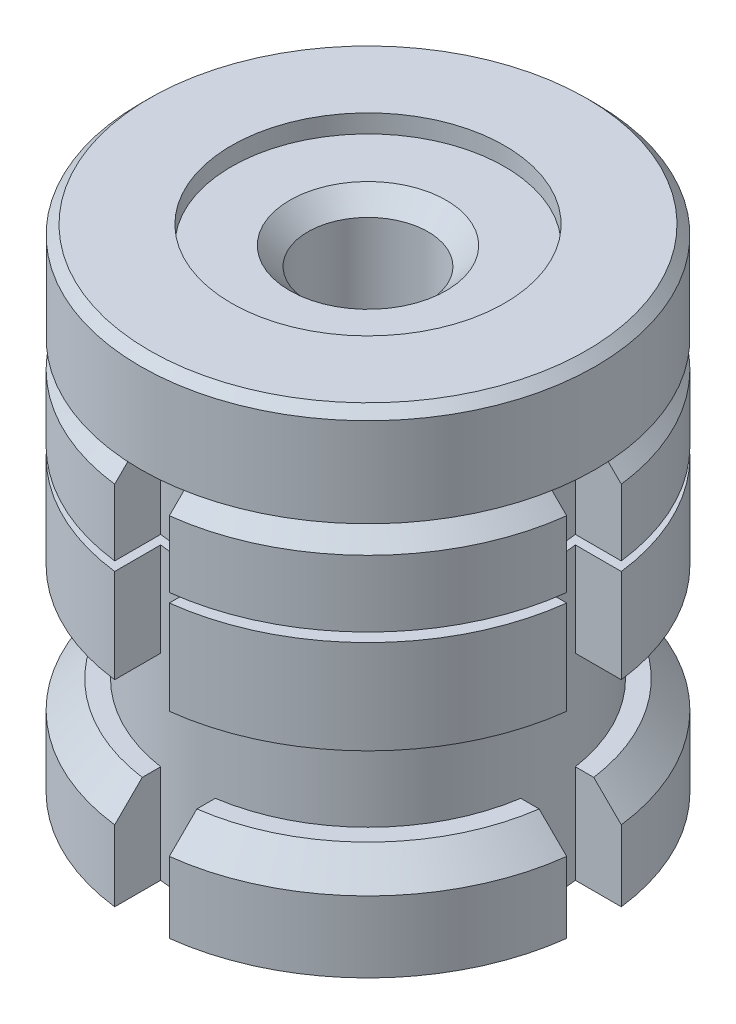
ISO-10303-21;
HEADER;
FILE_DESCRIPTION(('STEP AP214'),'2;1');
FILE_NAME('part.step','',(''),(''),'','','');
FILE_SCHEMA(('AUTOMOTIVE_DESIGN { 1 0 10303 214 1 1 1 1 }'));
ENDSEC;
DATA;
#1=APPLICATION_CONTEXT('core data for automotive mechanical design processes');
#2=APPLICATION_PROTOCOL_DEFINITION('international standard','automotive_design',2000,#1);
#3=PRODUCT_CONTEXT('',#1,'mechanical');
#4=PRODUCT('Part','Part','',(#3));
#5=PRODUCT_RELATED_PRODUCT_CATEGORY('part','',(#4));
#6=PRODUCT_DEFINITION_FORMATION('','',#4);
#7=PRODUCT_DEFINITION_CONTEXT('part definition',#1,'design');
#8=PRODUCT_DEFINITION('design','',#6,#7);
#9=PRODUCT_DEFINITION_SHAPE('','',#8);
#10=(LENGTH_UNIT() NAMED_UNIT(*) SI_UNIT(.MILLI.,.METRE.));
#11=(NAMED_UNIT(*) PLANE_ANGLE_UNIT() SI_UNIT($,.RADIAN.));
#12=(NAMED_UNIT(*) SI_UNIT($,.STERADIAN.) SOLID_ANGLE_UNIT());
#13=UNCERTAINTY_MEASURE_WITH_UNIT(LENGTH_MEASURE(1.E-05),#10,'distance_accuracy_value','');
#14=(GEOMETRIC_REPRESENTATION_CONTEXT(3) GLOBAL_UNCERTAINTY_ASSIGNED_CONTEXT((#13)) GLOBAL_UNIT_ASSIGNED_CONTEXT((#10,
#11,#12)) REPRESENTATION_CONTEXT('',''));
#15=CARTESIAN_POINT('',(0.,0.,0.));
#16=DIRECTION('',(0.,0.,1.));
#17=DIRECTION('',(1.,0.,0.));
#18=AXIS2_PLACEMENT_3D('',#15,#16,#17);
#19=CARTESIAN_POINT('',(0.,10.8,0.));
#20=DIRECTION('',(0.,-1.,0.));
#21=DIRECTION('',(0.,0.,-1.));
#22=AXIS2_PLACEMENT_3D('',#19,#20,#21);
#23=CYLINDRICAL_SURFACE('',#22,12.5);
#24=DIRECTION('',(0.,1.,0.));
#25=VECTOR('',#24,1.);
#26=CARTESIAN_POINT('',(-1.50000000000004,-14.7785048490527,12.4096736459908));
#27=LINE('',#26,#25);
#28=CARTESIAN_POINT('',(-1.50000000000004,5.65,12.4096736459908));
#29=VERTEX_POINT('',#28);
#30=CARTESIAN_POINT('',(-1.50000000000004,9.3,12.4096736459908));
#31=VERTEX_POINT('',#30);
#32=EDGE_CURVE('E1111',#29,#31,#27,.T.);
#33=ORIENTED_EDGE('',*,*,#32,.T.);
#34=CARTESIAN_POINT('',(0.,9.3,0.));
#35=DIRECTION('',(0.,1.,0.));
#36=DIRECTION('',(0.,0.,1.));
#37=AXIS2_PLACEMENT_3D('',#34,#35,#36);
#38=CIRCLE('',#37,12.5);
#39=CARTESIAN_POINT('',(-12.4096736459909,9.3,1.5));
#40=VERTEX_POINT('',#39);
#41=EDGE_CURVE('E55',#31,#40,#38,.F.);
#42=ORIENTED_EDGE('',*,*,#41,.T.);
#43=DIRECTION('',(0.,1.,0.));
#44=VECTOR('',#43,1.);
#45=CARTESIAN_POINT('',(-12.4096736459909,-14.7785048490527,1.5));
#46=LINE('',#45,#44);
#47=CARTESIAN_POINT('',(-12.4096736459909,5.65,1.5));
#48=VERTEX_POINT('',#47);
#49=EDGE_CURVE('E866',#48,#40,#46,.T.);
#50=ORIENTED_EDGE('',*,*,#49,.F.);
#51=CARTESIAN_POINT('',(0.,5.65,0.));
#52=DIRECTION('',(0.,1.,0.));
#53=DIRECTION('',(0.,0.,1.));
#54=AXIS2_PLACEMENT_3D('',#51,#52,#53);
#55=CIRCLE('',#54,12.5);
#56=EDGE_CURVE('E588',#48,#29,#55,.T.);
#57=ORIENTED_EDGE('',*,*,#56,.T.);
#58=EDGE_LOOP('',(#33,#42,#50,#57));
#59=FACE_BOUND('',#58,.T.);
#60=ADVANCED_FACE('F39',(#59),#23,.T.);
#61=DIRECTION('',(0.,1.,0.));
#62=VECTOR('',#61,1.);
#63=CARTESIAN_POINT('',(-12.4096736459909,-14.7785048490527,-1.5));
#64=LINE('',#63,#62);
#65=CARTESIAN_POINT('',(-12.4096736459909,5.65,-1.5));
#66=VERTEX_POINT('',#65);
#67=CARTESIAN_POINT('',(-12.4096736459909,9.30000000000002,-1.5));
#68=VERTEX_POINT('',#67);
#69=EDGE_CURVE('E883',#66,#68,#64,.T.);
#70=ORIENTED_EDGE('',*,*,#69,.T.);
#71=CARTESIAN_POINT('',(0.,9.30000000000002,0.));
#72=DIRECTION('',(0.,1.,0.));
#73=DIRECTION('',(0.,0.,1.));
#74=AXIS2_PLACEMENT_3D('',#71,#72,#73);
#75=CIRCLE('',#74,12.5);
#76=CARTESIAN_POINT('',(-1.50000000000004,9.30000000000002,-12.4096736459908));
#77=VERTEX_POINT('',#76);
#78=EDGE_CURVE('E646',#68,#77,#75,.F.);
#79=ORIENTED_EDGE('',*,*,#78,.T.);
#80=DIRECTION('',(0.,1.,0.));
#81=VECTOR('',#80,1.);
#82=CARTESIAN_POINT('',(-1.50000000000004,-14.7785048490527,-12.4096736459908));
#83=LINE('',#82,#81);
#84=CARTESIAN_POINT('',(-1.50000000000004,5.65,-12.4096736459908));
#85=VERTEX_POINT('',#84);
#86=EDGE_CURVE('E463',#85,#77,#83,.T.);
#87=ORIENTED_EDGE('',*,*,#86,.F.);
#88=EDGE_CURVE('E1225',#85,#66,#55,.T.);
#89=ORIENTED_EDGE('',*,*,#88,.T.);
#90=EDGE_LOOP('',(#70,#79,#87,#89));
#91=FACE_BOUND('',#90,.T.);
#92=ADVANCED_FACE('F1240',(#91),#23,.T.);
#93=DIRECTION('',(0.,1.,0.));
#94=VECTOR('',#93,1.);
#95=CARTESIAN_POINT('',(12.4096736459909,-14.7785048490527,1.50000000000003));
#96=LINE('',#95,#94);
#97=CARTESIAN_POINT('',(12.4096736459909,5.65,1.50000000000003));
#98=VERTEX_POINT('',#97);
#99=CARTESIAN_POINT('',(12.4096736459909,9.30000000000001,1.50000000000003));
#100=VERTEX_POINT('',#99);
#101=EDGE_CURVE('E1024',#98,#100,#96,.T.);
#102=ORIENTED_EDGE('',*,*,#101,.T.);
#103=CARTESIAN_POINT('',(0.,9.30000000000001,0.));
#104=DIRECTION('',(0.,1.,0.));
#105=DIRECTION('',(0.,0.,1.));
#106=AXIS2_PLACEMENT_3D('',#103,#104,#105);
#107=CIRCLE('',#106,12.5);
#108=CARTESIAN_POINT('',(1.50000000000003,9.30000000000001,12.4096736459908));
#109=VERTEX_POINT('',#108);
#110=EDGE_CURVE('E728',#100,#109,#107,.F.);
#111=ORIENTED_EDGE('',*,*,#110,.T.);
#112=DIRECTION('',(0.,1.,0.));
#113=VECTOR('',#112,1.);
#114=CARTESIAN_POINT('',(1.50000000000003,-14.7785048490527,12.4096736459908));
#115=LINE('',#114,#113);
#116=CARTESIAN_POINT('',(1.50000000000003,5.65,12.4096736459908));
#117=VERTEX_POINT('',#116);
#118=EDGE_CURVE('E1102',#117,#109,#115,.T.);
#119=ORIENTED_EDGE('',*,*,#118,.F.);
#120=EDGE_CURVE('E589',#117,#98,#55,.T.);
#121=ORIENTED_EDGE('',*,*,#120,.T.);
#122=EDGE_LOOP('',(#102,#111,#119,#121));
#123=FACE_BOUND('',#122,.T.);
#124=ADVANCED_FACE('F1100',(#123),#23,.T.);
#125=CARTESIAN_POINT('',(0.,5.65,12.5));
#126=DIRECTION('',(0.,1.,0.));
#127=DIRECTION('',(0.,0.,1.));
#128=AXIS2_PLACEMENT_3D('',#125,#126,#127);
#129=PLANE('',#128);
#130=CARTESIAN_POINT('',(0.,5.65,0.));
#131=DIRECTION('',(0.,1.,0.));
#132=DIRECTION('',(0.,0.,1.));
#133=AXIS2_PLACEMENT_3D('',#130,#131,#132);
#134=CIRCLE('',#133,7.5);
#135=CARTESIAN_POINT('',(0.,5.65,7.5));
#136=VERTEX_POINT('',#135);
#137=EDGE_CURVE('E593',#136,#136,#134,.T.);
#138=ORIENTED_EDGE('',*,*,#137,.T.);
#139=EDGE_LOOP('',(#138));
#140=FACE_BOUND('',#139,.T.);
#141=ORIENTED_EDGE('',*,*,#56,.F.);
#142=DIRECTION('',(1.,0.,0.));
#143=VECTOR('',#142,1.);
#144=CARTESIAN_POINT('',(0.,5.65,1.5));
#145=LINE('',#144,#143);
#146=CARTESIAN_POINT('',(-9.8868599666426,5.65,1.49999999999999));
#147=VERTEX_POINT('',#146);
#148=EDGE_CURVE('E563',#48,#147,#145,.T.);
#149=ORIENTED_EDGE('',*,*,#148,.T.);
#150=CARTESIAN_POINT('',(0.,5.65,0.));
#151=DIRECTION('',(0.,1.,0.));
#152=DIRECTION('',(0.,0.,1.));
#153=AXIS2_PLACEMENT_3D('',#150,#151,#152);
#154=CIRCLE('',#153,10.);
#155=CARTESIAN_POINT('',(-9.88685996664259,5.65,-1.5));
#156=VERTEX_POINT('',#155);
#157=EDGE_CURVE('E547',#147,#156,#154,.F.);
#158=ORIENTED_EDGE('',*,*,#157,.T.);
#159=DIRECTION('',(-1.,0.,0.));
#160=VECTOR('',#159,1.);
#161=CARTESIAN_POINT('',(0.,5.65,-1.5));
#162=LINE('',#161,#160);
#163=EDGE_CURVE('E541',#156,#66,#162,.T.);
#164=ORIENTED_EDGE('',*,*,#163,.T.);
#165=ORIENTED_EDGE('',*,*,#88,.F.);
#166=DIRECTION('',(0.,0.,1.));
#167=VECTOR('',#166,1.);
#168=CARTESIAN_POINT('',(-1.50000000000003,5.65,12.5));
#169=LINE('',#168,#167);
#170=CARTESIAN_POINT('',(-1.50000000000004,5.65,-9.88685996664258));
#171=VERTEX_POINT('',#170);
#172=EDGE_CURVE('E527',#85,#171,#169,.T.);
#173=ORIENTED_EDGE('',*,*,#172,.T.);
#174=CARTESIAN_POINT('',(0.,5.65,0.));
#175=DIRECTION('',(0.,1.,0.));
#176=DIRECTION('',(0.,0.,1.));
#177=AXIS2_PLACEMENT_3D('',#174,#175,#176);
#178=CIRCLE('',#177,9.99999999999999);
#179=CARTESIAN_POINT('',(1.50000000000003,5.65,-9.88685996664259));
#180=VERTEX_POINT('',#179);
#181=EDGE_CURVE('E422',#171,#180,#178,.F.);
#182=ORIENTED_EDGE('',*,*,#181,.T.);
#183=DIRECTION('',(0.,0.,-1.));
#184=VECTOR('',#183,1.);
#185=CARTESIAN_POINT('',(1.50000000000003,5.65,12.5));
#186=LINE('',#185,#184);
#187=CARTESIAN_POINT('',(1.50000000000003,5.65,-12.4096736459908));
#188=VERTEX_POINT('',#187);
#189=EDGE_CURVE('E500',#180,#188,#186,.T.);
#190=ORIENTED_EDGE('',*,*,#189,.T.);
#191=CARTESIAN_POINT('',(12.4096736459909,5.65,-1.5));
#192=VERTEX_POINT('',#191);
#193=EDGE_CURVE('E594',#192,#188,#55,.T.);
#194=ORIENTED_EDGE('',*,*,#193,.F.);
#195=DIRECTION('',(-1.,0.,0.));
#196=VECTOR('',#195,1.);
#197=CARTESIAN_POINT('',(0.,5.65,-1.5));
#198=LINE('',#197,#196);
#199=CARTESIAN_POINT('',(9.88685996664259,5.65,-1.5));
#200=VERTEX_POINT('',#199);
#201=EDGE_CURVE('E1065',#192,#200,#198,.T.);
#202=ORIENTED_EDGE('',*,*,#201,.T.);
#203=CARTESIAN_POINT('',(0.,5.65,0.));
#204=DIRECTION('',(0.,1.,0.));
#205=DIRECTION('',(0.,0.,1.));
#206=AXIS2_PLACEMENT_3D('',#203,#204,#205);
#207=CIRCLE('',#206,10.);
#208=CARTESIAN_POINT('',(9.88685996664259,5.65,1.50000000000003));
#209=VERTEX_POINT('',#208);
#210=EDGE_CURVE('E1063',#200,#209,#207,.F.);
#211=ORIENTED_EDGE('',*,*,#210,.T.);
#212=DIRECTION('',(1.,0.,0.));
#213=VECTOR('',#212,1.);
#214=CARTESIAN_POINT('',(0.,5.65,1.50000000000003));
#215=LINE('',#214,#213);
#216=EDGE_CURVE('E993',#209,#98,#215,.T.);
#217=ORIENTED_EDGE('',*,*,#216,.T.);
#218=ORIENTED_EDGE('',*,*,#120,.F.);
#219=DIRECTION('',(0.,0.,-1.));
#220=VECTOR('',#219,1.);
#221=CARTESIAN_POINT('',(1.50000000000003,5.65,12.5));
#222=LINE('',#221,#220);
#223=CARTESIAN_POINT('',(1.50000000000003,5.65,9.88685996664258));
#224=VERTEX_POINT('',#223);
#225=EDGE_CURVE('E847',#117,#224,#222,.T.);
#226=ORIENTED_EDGE('',*,*,#225,.T.);
#227=CARTESIAN_POINT('',(0.,5.65,0.));
#228=DIRECTION('',(0.,1.,0.));
#229=DIRECTION('',(0.,0.,1.));
#230=AXIS2_PLACEMENT_3D('',#227,#228,#229);
#231=CIRCLE('',#230,9.99999999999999);
#232=CARTESIAN_POINT('',(-1.50000000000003,5.65,9.88685996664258));
#233=VERTEX_POINT('',#232);
#234=EDGE_CURVE('E871',#224,#233,#231,.F.);
#235=ORIENTED_EDGE('',*,*,#234,.T.);
#236=DIRECTION('',(0.,0.,1.));
#237=VECTOR('',#236,1.);
#238=CARTESIAN_POINT('',(-1.50000000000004,5.65,12.5));
#239=LINE('',#238,#237);
#240=EDGE_CURVE('E1156',#233,#29,#239,.T.);
#241=ORIENTED_EDGE('',*,*,#240,.T.);
#242=EDGE_LOOP('',(#141,#149,#158,#164,#165,#173,#182,#190,#194,#202,#211,#217,#218,#226,#235,#241));
#243=FACE_BOUND('',#242,.T.);
#244=ADVANCED_FACE('F1069',(#140,#243),#129,.F.);
#245=CARTESIAN_POINT('',(0.,5.15,12.5));
#246=DIRECTION('',(0.,-1.,0.));
#247=DIRECTION('',(0.,0.,-1.));
#248=AXIS2_PLACEMENT_3D('',#245,#246,#247);
#249=PLANE('',#248);
#250=CARTESIAN_POINT('',(0.,5.15,0.));
#251=DIRECTION('',(0.,1.,0.));
#252=DIRECTION('',(0.,0.,1.));
#253=AXIS2_PLACEMENT_3D('',#250,#251,#252);
#254=CIRCLE('',#253,7.5);
#255=CARTESIAN_POINT('',(0.,5.15,7.5));
#256=VERTEX_POINT('',#255);
#257=EDGE_CURVE('E572',#256,#256,#254,.T.);
#258=ORIENTED_EDGE('',*,*,#257,.F.);
#259=EDGE_LOOP('',(#258));
#260=FACE_BOUND('',#259,.T.);
#261=CARTESIAN_POINT('',(0.,5.15,0.));
#262=DIRECTION('',(0.,-1.,0.));
#263=DIRECTION('',(0.,0.,-1.));
#264=AXIS2_PLACEMENT_3D('',#261,#262,#263);
#265=CIRCLE('',#264,10.);
#266=CARTESIAN_POINT('',(-9.88685996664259,5.15,-1.5));
#267=VERTEX_POINT('',#266);
#268=CARTESIAN_POINT('',(-9.8868599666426,5.15,1.49999999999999));
#269=VERTEX_POINT('',#268);
#270=EDGE_CURVE('E545',#267,#269,#265,.F.);
#271=ORIENTED_EDGE('',*,*,#270,.T.);
#272=DIRECTION('',(-1.,0.,0.));
#273=VECTOR('',#272,1.);
#274=CARTESIAN_POINT('',(0.,5.15,1.5));
#275=LINE('',#274,#273);
#276=CARTESIAN_POINT('',(-12.4096736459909,5.15,1.5));
#277=VERTEX_POINT('',#276);
#278=EDGE_CURVE('E559',#269,#277,#275,.T.);
#279=ORIENTED_EDGE('',*,*,#278,.T.);
#280=CARTESIAN_POINT('',(0.,5.15,0.));
#281=DIRECTION('',(0.,1.,0.));
#282=DIRECTION('',(0.,0.,1.));
#283=AXIS2_PLACEMENT_3D('',#280,#281,#282);
#284=CIRCLE('',#283,12.5);
#285=CARTESIAN_POINT('',(-1.50000000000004,5.15,12.4096736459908));
#286=VERTEX_POINT('',#285);
#287=EDGE_CURVE('E583',#277,#286,#284,.T.);
#288=ORIENTED_EDGE('',*,*,#287,.T.);
#289=DIRECTION('',(0.,0.,-1.));
#290=VECTOR('',#289,1.);
#291=CARTESIAN_POINT('',(-1.50000000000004,5.15,12.5));
#292=LINE('',#291,#290);
#293=CARTESIAN_POINT('',(-1.50000000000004,5.15,9.88685996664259));
#294=VERTEX_POINT('',#293);
#295=EDGE_CURVE('E1151',#286,#294,#292,.T.);
#296=ORIENTED_EDGE('',*,*,#295,.T.);
#297=CARTESIAN_POINT('',(0.,5.15,0.));
#298=DIRECTION('',(0.,-1.,0.));
#299=DIRECTION('',(0.,0.,-1.));
#300=AXIS2_PLACEMENT_3D('',#297,#298,#299);
#301=CIRCLE('',#300,9.99999999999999);
#302=CARTESIAN_POINT('',(1.50000000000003,5.15,9.88685996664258));
#303=VERTEX_POINT('',#302);
#304=EDGE_CURVE('E863',#294,#303,#301,.F.);
#305=ORIENTED_EDGE('',*,*,#304,.T.);
#306=DIRECTION('',(0.,0.,1.));
#307=VECTOR('',#306,1.);
#308=CARTESIAN_POINT('',(1.50000000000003,5.15,12.5));
#309=LINE('',#308,#307);
#310=CARTESIAN_POINT('',(1.50000000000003,5.15,12.4096736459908));
#311=VERTEX_POINT('',#310);
#312=EDGE_CURVE('E1148',#303,#311,#309,.T.);
#313=ORIENTED_EDGE('',*,*,#312,.T.);
#314=CARTESIAN_POINT('',(12.4096736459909,5.15,1.50000000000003));
#315=VERTEX_POINT('',#314);
#316=EDGE_CURVE('E584',#311,#315,#284,.T.);
#317=ORIENTED_EDGE('',*,*,#316,.T.);
#318=DIRECTION('',(-1.,0.,0.));
#319=VECTOR('',#318,1.);
#320=CARTESIAN_POINT('',(0.,5.15,1.50000000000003));
#321=LINE('',#320,#319);
#322=CARTESIAN_POINT('',(9.88685996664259,5.15,1.50000000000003));
#323=VERTEX_POINT('',#322);
#324=EDGE_CURVE('E1088',#315,#323,#321,.T.);
#325=ORIENTED_EDGE('',*,*,#324,.T.);
#326=CARTESIAN_POINT('',(0.,5.15,0.));
#327=DIRECTION('',(0.,-1.,0.));
#328=DIRECTION('',(0.,0.,-1.));
#329=AXIS2_PLACEMENT_3D('',#326,#327,#328);
#330=CIRCLE('',#329,10.);
#331=CARTESIAN_POINT('',(9.88685996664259,5.15,-1.5));
#332=VERTEX_POINT('',#331);
#333=EDGE_CURVE('E1159',#323,#332,#330,.F.);
#334=ORIENTED_EDGE('',*,*,#333,.T.);
#335=DIRECTION('',(1.,0.,0.));
#336=VECTOR('',#335,1.);
#337=CARTESIAN_POINT('',(0.,5.15,-1.5));
#338=LINE('',#337,#336);
#339=CARTESIAN_POINT('',(12.4096736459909,5.15,-1.5));
#340=VERTEX_POINT('',#339);
#341=EDGE_CURVE('E1074',#332,#340,#338,.T.);
#342=ORIENTED_EDGE('',*,*,#341,.T.);
#343=CARTESIAN_POINT('',(1.50000000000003,5.15,-12.4096736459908));
#344=VERTEX_POINT('',#343);
#345=EDGE_CURVE('E498',#340,#344,#284,.T.);
#346=ORIENTED_EDGE('',*,*,#345,.T.);
#347=DIRECTION('',(0.,0.,1.));
#348=VECTOR('',#347,1.);
#349=CARTESIAN_POINT('',(1.50000000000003,5.15,12.5));
#350=LINE('',#349,#348);
#351=CARTESIAN_POINT('',(1.50000000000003,5.15,-9.88685996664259));
#352=VERTEX_POINT('',#351);
#353=EDGE_CURVE('E482',#344,#352,#350,.T.);
#354=ORIENTED_EDGE('',*,*,#353,.T.);
#355=CARTESIAN_POINT('',(0.,5.15,0.));
#356=DIRECTION('',(0.,-1.,0.));
#357=DIRECTION('',(0.,0.,-1.));
#358=AXIS2_PLACEMENT_3D('',#355,#356,#357);
#359=CIRCLE('',#358,9.99999999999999);
#360=CARTESIAN_POINT('',(-1.50000000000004,5.15,-9.88685996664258));
#361=VERTEX_POINT('',#360);
#362=EDGE_CURVE('E495',#352,#361,#359,.F.);
#363=ORIENTED_EDGE('',*,*,#362,.T.);
#364=DIRECTION('',(0.,0.,-1.));
#365=VECTOR('',#364,1.);
#366=CARTESIAN_POINT('',(-1.50000000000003,5.15,12.5));
#367=LINE('',#366,#365);
#368=CARTESIAN_POINT('',(-1.50000000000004,5.15,-12.4096736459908));
#369=VERTEX_POINT('',#368);
#370=EDGE_CURVE('E524',#361,#369,#367,.T.);
#371=ORIENTED_EDGE('',*,*,#370,.T.);
#372=CARTESIAN_POINT('',(-12.4096736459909,5.15,-1.5));
#373=VERTEX_POINT('',#372);
#374=EDGE_CURVE('E1863',#369,#373,#284,.T.);
#375=ORIENTED_EDGE('',*,*,#374,.T.);
#376=DIRECTION('',(1.,0.,0.));
#377=VECTOR('',#376,1.);
#378=CARTESIAN_POINT('',(0.,5.15,-1.5));
#379=LINE('',#378,#377);
#380=EDGE_CURVE('E537',#373,#267,#379,.T.);
#381=ORIENTED_EDGE('',*,*,#380,.T.);
#382=EDGE_LOOP('',(#271,#279,#288,#296,#305,#313,#317,#325,#334,#342,#346,#354,#363,#371,#375,#381));
#383=FACE_BOUND('',#382,.T.);
#384=ADVANCED_FACE('F493',(#260,#383),#249,.F.);
#385=CARTESIAN_POINT('',(0.,0.,0.));
#386=DIRECTION('',(0.,1.,0.));
#387=DIRECTION('',(0.,0.,1.));
#388=AXIS2_PLACEMENT_3D('',#385,#386,#387);
#389=PLANE('',#388);
#390=CARTESIAN_POINT('',(0.,0.,0.));
#391=DIRECTION('',(0.,1.,0.));
#392=DIRECTION('',(0.,0.,1.));
#393=AXIS2_PLACEMENT_3D('',#390,#391,#392);
#394=CIRCLE('',#393,12.5);
#395=CARTESIAN_POINT('',(-12.4096736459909,0.,1.5));
#396=VERTEX_POINT('',#395);
#397=CARTESIAN_POINT('',(-1.50000000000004,0.,12.4096736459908));
#398=VERTEX_POINT('',#397);
#399=EDGE_CURVE('E598',#396,#398,#394,.T.);
#400=ORIENTED_EDGE('',*,*,#399,.F.);
#401=DIRECTION('',(1.,0.,0.));
#402=VECTOR('',#401,1.);
#403=CARTESIAN_POINT('',(0.,0.,1.5));
#404=LINE('',#403,#402);
#405=CARTESIAN_POINT('',(-9.8868599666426,0.,1.49999999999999));
#406=VERTEX_POINT('',#405);
#407=EDGE_CURVE('E555',#396,#406,#404,.T.);
#408=ORIENTED_EDGE('',*,*,#407,.T.);
#409=CARTESIAN_POINT('',(0.,0.,0.));
#410=DIRECTION('',(0.,-1.,0.));
#411=DIRECTION('',(0.,0.,-1.));
#412=AXIS2_PLACEMENT_3D('',#409,#410,#411);
#413=CIRCLE('',#412,10.);
#414=CARTESIAN_POINT('',(-1.50000000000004,0.,9.88685996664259));
#415=VERTEX_POINT('',#414);
#416=EDGE_CURVE('E1291',#415,#406,#413,.T.);
#417=ORIENTED_EDGE('',*,*,#416,.F.);
#418=DIRECTION('',(0.,0.,1.));
#419=VECTOR('',#418,1.);
#420=CARTESIAN_POINT('',(-1.50000000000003,0.,0.));
#421=LINE('',#420,#419);
#422=EDGE_CURVE('E846',#415,#398,#421,.T.);
#423=ORIENTED_EDGE('',*,*,#422,.T.);
#424=EDGE_LOOP('',(#400,#408,#417,#423));
#425=FACE_BOUND('',#424,.T.);
#426=ADVANCED_FACE('F1255',(#425),#389,.F.);
#427=CARTESIAN_POINT('',(-9.88685996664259,0.,-1.5));
#428=VERTEX_POINT('',#427);
#429=CARTESIAN_POINT('',(-1.50000000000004,0.,-9.88685996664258));
#430=VERTEX_POINT('',#429);
#431=EDGE_CURVE('E579',#428,#430,#413,.T.);
#432=ORIENTED_EDGE('',*,*,#431,.F.);
#433=DIRECTION('',(-1.,0.,0.));
#434=VECTOR('',#433,1.);
#435=CARTESIAN_POINT('',(0.,0.,-1.5));
#436=LINE('',#435,#434);
#437=CARTESIAN_POINT('',(-12.4096736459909,0.,-1.5));
#438=VERTEX_POINT('',#437);
#439=EDGE_CURVE('E533',#428,#438,#436,.T.);
#440=ORIENTED_EDGE('',*,*,#439,.T.);
#441=CARTESIAN_POINT('',(-1.50000000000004,0.,-12.4096736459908));
#442=VERTEX_POINT('',#441);
#443=EDGE_CURVE('E1281',#442,#438,#394,.T.);
#444=ORIENTED_EDGE('',*,*,#443,.F.);
#445=DIRECTION('',(0.,0.,1.));
#446=VECTOR('',#445,1.);
#447=CARTESIAN_POINT('',(-1.50000000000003,0.,0.));
#448=LINE('',#447,#446);
#449=EDGE_CURVE('E520',#442,#430,#448,.T.);
#450=ORIENTED_EDGE('',*,*,#449,.T.);
#451=EDGE_LOOP('',(#432,#440,#444,#450));
#452=FACE_BOUND('',#451,.T.);
#453=ADVANCED_FACE('F1497',(#452),#389,.F.);
#454=CARTESIAN_POINT('',(9.88685996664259,0.,1.50000000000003));
#455=VERTEX_POINT('',#454);
#456=CARTESIAN_POINT('',(1.50000000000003,0.,9.88685996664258));
#457=VERTEX_POINT('',#456);
#458=EDGE_CURVE('E578',#455,#457,#413,.T.);
#459=ORIENTED_EDGE('',*,*,#458,.F.);
#460=DIRECTION('',(1.,0.,0.));
#461=VECTOR('',#460,1.);
#462=CARTESIAN_POINT('',(0.,0.,1.50000000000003));
#463=LINE('',#462,#461);
#464=CARTESIAN_POINT('',(12.4096736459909,0.,1.50000000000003));
#465=VERTEX_POINT('',#464);
#466=EDGE_CURVE('E1079',#455,#465,#463,.T.);
#467=ORIENTED_EDGE('',*,*,#466,.T.);
#468=CARTESIAN_POINT('',(1.50000000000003,0.,12.4096736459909));
#469=VERTEX_POINT('',#468);
#470=EDGE_CURVE('E599',#469,#465,#394,.T.);
#471=ORIENTED_EDGE('',*,*,#470,.F.);
#472=DIRECTION('',(0.,0.,-1.));
#473=VECTOR('',#472,1.);
#474=CARTESIAN_POINT('',(1.50000000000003,0.,0.));
#475=LINE('',#474,#473);
#476=EDGE_CURVE('E1188',#469,#457,#475,.T.);
#477=ORIENTED_EDGE('',*,*,#476,.T.);
#478=EDGE_LOOP('',(#459,#467,#471,#477));
#479=FACE_BOUND('',#478,.T.);
#480=ADVANCED_FACE('F1187',(#479),#389,.F.);
#481=ORIENTED_EDGE('',*,*,#287,.F.);
#482=EDGE_CURVE('E864',#396,#277,#46,.T.);
#483=ORIENTED_EDGE('',*,*,#482,.F.);
#484=ORIENTED_EDGE('',*,*,#399,.T.);
#485=EDGE_CURVE('E1109',#398,#286,#27,.T.);
#486=ORIENTED_EDGE('',*,*,#485,.T.);
#487=EDGE_LOOP('',(#481,#483,#484,#486));
#488=FACE_BOUND('',#487,.T.);
#489=ADVANCED_FACE('F1272',(#488),#23,.T.);
#490=ORIENTED_EDGE('',*,*,#443,.T.);
#491=EDGE_CURVE('E881',#438,#373,#64,.T.);
#492=ORIENTED_EDGE('',*,*,#491,.T.);
#493=ORIENTED_EDGE('',*,*,#374,.F.);
#494=EDGE_CURVE('E954',#442,#369,#83,.T.);
#495=ORIENTED_EDGE('',*,*,#494,.F.);
#496=EDGE_LOOP('',(#490,#492,#493,#495));
#497=FACE_BOUND('',#496,.T.);
#498=ADVANCED_FACE('F1266',(#497),#23,.T.);
#499=ORIENTED_EDGE('',*,*,#470,.T.);
#500=EDGE_CURVE('E1023',#465,#315,#96,.T.);
#501=ORIENTED_EDGE('',*,*,#500,.T.);
#502=ORIENTED_EDGE('',*,*,#316,.F.);
#503=EDGE_CURVE('E1104',#469,#311,#115,.T.);
#504=ORIENTED_EDGE('',*,*,#503,.F.);
#505=EDGE_LOOP('',(#499,#501,#502,#504));
#506=FACE_BOUND('',#505,.T.);
#507=ADVANCED_FACE('F1183',(#506),#23,.T.);
#508=CARTESIAN_POINT('',(0.,-5.4,0.));
#509=DIRECTION('',(0.,-1.,0.));
#510=DIRECTION('',(0.,0.,-1.));
#511=AXIS2_PLACEMENT_3D('',#508,#509,#510);
#512=CYLINDRICAL_SURFACE('',#511,12.5);
#513=CARTESIAN_POINT('',(-1.50000000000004,-10.8,12.4096736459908));
#514=VERTEX_POINT('',#513);
#515=CARTESIAN_POINT('',(-1.50000000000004,-6.90000000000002,12.4096736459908));
#516=VERTEX_POINT('',#515);
#517=EDGE_CURVE('E857',#514,#516,#27,.T.);
#518=ORIENTED_EDGE('',*,*,#517,.T.);
#519=CARTESIAN_POINT('',(0.,-6.90000000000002,0.));
#520=DIRECTION('',(0.,-1.,0.));
#521=DIRECTION('',(0.,0.,-1.));
#522=AXIS2_PLACEMENT_3D('',#519,#520,#521);
#523=CIRCLE('',#522,12.5);
#524=CARTESIAN_POINT('',(-12.4096736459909,-6.90000000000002,1.5));
#525=VERTEX_POINT('',#524);
#526=EDGE_CURVE('E775',#516,#525,#523,.T.);
#527=ORIENTED_EDGE('',*,*,#526,.T.);
#528=CARTESIAN_POINT('',(-12.4096736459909,-10.8,1.5));
#529=VERTEX_POINT('',#528);
#530=EDGE_CURVE('E855',#529,#525,#46,.T.);
#531=ORIENTED_EDGE('',*,*,#530,.F.);
#532=CARTESIAN_POINT('',(0.,-10.8,0.));
#533=DIRECTION('',(0.,-1.,0.));
#534=DIRECTION('',(0.,0.,-1.));
#535=AXIS2_PLACEMENT_3D('',#532,#533,#534);
#536=CIRCLE('',#535,12.5);
#537=EDGE_CURVE('E1873',#514,#529,#536,.T.);
#538=ORIENTED_EDGE('',*,*,#537,.F.);
#539=EDGE_LOOP('',(#518,#527,#531,#538));
#540=FACE_BOUND('',#539,.T.);
#541=ADVANCED_FACE('F853',(#540),#512,.T.);
#542=CARTESIAN_POINT('',(-12.4096736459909,-10.8,-1.5));
#543=VERTEX_POINT('',#542);
#544=CARTESIAN_POINT('',(-12.4096736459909,-6.90000000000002,-1.5));
#545=VERTEX_POINT('',#544);
#546=EDGE_CURVE('E876',#543,#545,#64,.T.);
#547=ORIENTED_EDGE('',*,*,#546,.T.);
#548=CARTESIAN_POINT('',(0.,-6.90000000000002,0.));
#549=DIRECTION('',(0.,-1.,0.));
#550=DIRECTION('',(0.,0.,-1.));
#551=AXIS2_PLACEMENT_3D('',#548,#549,#550);
#552=CIRCLE('',#551,12.5);
#553=CARTESIAN_POINT('',(-1.50000000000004,-6.90000000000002,-12.4096736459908));
#554=VERTEX_POINT('',#553);
#555=EDGE_CURVE('E608',#545,#554,#552,.T.);
#556=ORIENTED_EDGE('',*,*,#555,.T.);
#557=CARTESIAN_POINT('',(-1.50000000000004,-10.8,-12.4096736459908));
#558=VERTEX_POINT('',#557);
#559=EDGE_CURVE('E950',#558,#554,#83,.T.);
#560=ORIENTED_EDGE('',*,*,#559,.F.);
#561=EDGE_CURVE('E567',#543,#558,#536,.T.);
#562=ORIENTED_EDGE('',*,*,#561,.F.);
#563=EDGE_LOOP('',(#547,#556,#560,#562));
#564=FACE_BOUND('',#563,.T.);
#565=ADVANCED_FACE('F1271',(#564),#512,.T.);
#566=CARTESIAN_POINT('',(12.4096736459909,-10.8,1.50000000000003));
#567=VERTEX_POINT('',#566);
#568=CARTESIAN_POINT('',(12.4096736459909,-6.90000000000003,1.50000000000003));
#569=VERTEX_POINT('',#568);
#570=EDGE_CURVE('E1017',#567,#569,#96,.T.);
#571=ORIENTED_EDGE('',*,*,#570,.T.);
#572=CARTESIAN_POINT('',(0.,-6.90000000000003,0.));
#573=DIRECTION('',(0.,-1.,0.));
#574=DIRECTION('',(0.,0.,-1.));
#575=AXIS2_PLACEMENT_3D('',#572,#573,#574);
#576=CIRCLE('',#575,12.5);
#577=CARTESIAN_POINT('',(1.50000000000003,-6.90000000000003,12.4096736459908));
#578=VERTEX_POINT('',#577);
#579=EDGE_CURVE('E747',#569,#578,#576,.T.);
#580=ORIENTED_EDGE('',*,*,#579,.T.);
#581=CARTESIAN_POINT('',(1.50000000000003,-10.8,12.4096736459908));
#582=VERTEX_POINT('',#581);
#583=EDGE_CURVE('E1106',#582,#578,#115,.T.);
#584=ORIENTED_EDGE('',*,*,#583,.F.);
#585=EDGE_CURVE('E573',#567,#582,#536,.T.);
#586=ORIENTED_EDGE('',*,*,#585,.F.);
#587=EDGE_LOOP('',(#571,#580,#584,#586));
#588=FACE_BOUND('',#587,.T.);
#589=ADVANCED_FACE('F1253',(#588),#512,.T.);
#590=CARTESIAN_POINT('',(0.,-5.4,0.));
#591=DIRECTION('',(0.,-1.,0.));
#592=DIRECTION('',(0.,0.,-1.));
#593=AXIS2_PLACEMENT_3D('',#590,#591,#592);
#594=PLANE('',#593);
#595=DIRECTION('',(-1.,0.,0.));
#596=VECTOR('',#595,1.);
#597=CARTESIAN_POINT('',(0.,-5.4,1.5));
#598=LINE('',#597,#596);
#599=CARTESIAN_POINT('',(-9.8868599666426,-5.4,1.49999999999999));
#600=VERTEX_POINT('',#599);
#601=CARTESIAN_POINT('',(-10.8972473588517,-5.4,1.5));
#602=VERTEX_POINT('',#601);
#603=EDGE_CURVE('E551',#600,#602,#598,.T.);
#604=ORIENTED_EDGE('',*,*,#603,.T.);
#605=CARTESIAN_POINT('',(0.,-5.4,0.));
#606=DIRECTION('',(0.,-1.,0.));
#607=DIRECTION('',(0.,0.,-1.));
#608=AXIS2_PLACEMENT_3D('',#605,#606,#607);
#609=CIRCLE('',#608,11.);
#610=CARTESIAN_POINT('',(-1.50000000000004,-5.4,10.8972473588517));
#611=VERTEX_POINT('',#610);
#612=EDGE_CURVE('E784',#602,#611,#609,.F.);
#613=ORIENTED_EDGE('',*,*,#612,.T.);
#614=DIRECTION('',(0.,0.,-1.));
#615=VECTOR('',#614,1.);
#616=CARTESIAN_POINT('',(-1.50000000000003,-5.4,0.));
#617=LINE('',#616,#615);
#618=CARTESIAN_POINT('',(-1.50000000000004,-5.4,9.88685996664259));
#619=VERTEX_POINT('',#618);
#620=EDGE_CURVE('E838',#611,#619,#617,.T.);
#621=ORIENTED_EDGE('',*,*,#620,.T.);
#622=CARTESIAN_POINT('',(0.,-5.4,0.));
#623=DIRECTION('',(0.,-1.,0.));
#624=DIRECTION('',(0.,0.,-1.));
#625=AXIS2_PLACEMENT_3D('',#622,#623,#624);
#626=CIRCLE('',#625,10.);
#627=EDGE_CURVE('E1859',#619,#600,#626,.T.);
#628=ORIENTED_EDGE('',*,*,#627,.T.);
#629=EDGE_LOOP('',(#604,#613,#621,#628));
#630=FACE_BOUND('',#629,.T.);
#631=ADVANCED_FACE('F836',(#630),#594,.F.);
#632=DIRECTION('',(0.,0.,-1.));
#633=VECTOR('',#632,1.);
#634=CARTESIAN_POINT('',(-1.50000000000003,-5.4,0.));
#635=LINE('',#634,#633);
#636=CARTESIAN_POINT('',(-1.50000000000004,-5.4,-9.88685996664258));
#637=VERTEX_POINT('',#636);
#638=CARTESIAN_POINT('',(-1.50000000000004,-5.4,-10.8972473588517));
#639=VERTEX_POINT('',#638);
#640=EDGE_CURVE('E516',#637,#639,#635,.T.);
#641=ORIENTED_EDGE('',*,*,#640,.T.);
#642=CARTESIAN_POINT('',(0.,-5.4,0.));
#643=DIRECTION('',(0.,-1.,0.));
#644=DIRECTION('',(0.,0.,-1.));
#645=AXIS2_PLACEMENT_3D('',#642,#643,#644);
#646=CIRCLE('',#645,11.);
#647=CARTESIAN_POINT('',(-10.8972473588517,-5.4,-1.5));
#648=VERTEX_POINT('',#647);
#649=EDGE_CURVE('E621',#639,#648,#646,.F.);
#650=ORIENTED_EDGE('',*,*,#649,.T.);
#651=DIRECTION('',(1.,0.,0.));
#652=VECTOR('',#651,1.);
#653=CARTESIAN_POINT('',(0.,-5.4,-1.5));
#654=LINE('',#653,#652);
#655=CARTESIAN_POINT('',(-9.88685996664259,-5.4,-1.5));
#656=VERTEX_POINT('',#655);
#657=EDGE_CURVE('E530',#648,#656,#654,.T.);
#658=ORIENTED_EDGE('',*,*,#657,.T.);
#659=EDGE_CURVE('E577',#656,#637,#626,.T.);
#660=ORIENTED_EDGE('',*,*,#659,.T.);
#661=EDGE_LOOP('',(#641,#650,#658,#660));
#662=FACE_BOUND('',#661,.T.);
#663=ADVANCED_FACE('F1359',(#662),#594,.F.);
#664=DIRECTION('',(0.,0.,1.));
#665=VECTOR('',#664,1.);
#666=CARTESIAN_POINT('',(1.50000000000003,-5.4,0.));
#667=LINE('',#666,#665);
#668=CARTESIAN_POINT('',(1.50000000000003,-5.4,9.88685996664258));
#669=VERTEX_POINT('',#668);
#670=CARTESIAN_POINT('',(1.50000000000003,-5.4,10.8972473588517));
#671=VERTEX_POINT('',#670);
#672=EDGE_CURVE('E1212',#669,#671,#667,.T.);
#673=ORIENTED_EDGE('',*,*,#672,.T.);
#674=CARTESIAN_POINT('',(0.,-5.4,0.));
#675=DIRECTION('',(0.,-1.,0.));
#676=DIRECTION('',(0.,0.,-1.));
#677=AXIS2_PLACEMENT_3D('',#674,#675,#676);
#678=CIRCLE('',#677,11.);
#679=CARTESIAN_POINT('',(10.8972473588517,-5.4,1.50000000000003));
#680=VERTEX_POINT('',#679);
#681=EDGE_CURVE('E767',#671,#680,#678,.F.);
#682=ORIENTED_EDGE('',*,*,#681,.T.);
#683=DIRECTION('',(-1.,0.,0.));
#684=VECTOR('',#683,1.);
#685=CARTESIAN_POINT('',(0.,-5.4,1.50000000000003));
#686=LINE('',#685,#684);
#687=CARTESIAN_POINT('',(9.88685996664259,-5.4,1.50000000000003));
#688=VERTEX_POINT('',#687);
#689=EDGE_CURVE('E1073',#680,#688,#686,.T.);
#690=ORIENTED_EDGE('',*,*,#689,.T.);
#691=EDGE_CURVE('E609',#688,#669,#626,.T.);
#692=ORIENTED_EDGE('',*,*,#691,.T.);
#693=EDGE_LOOP('',(#673,#682,#690,#692));
#694=FACE_BOUND('',#693,.T.);
#695=ADVANCED_FACE('F1354',(#694),#594,.F.);
#696=CARTESIAN_POINT('',(0.,-10.8,0.));
#697=DIRECTION('',(0.,-1.,0.));
#698=DIRECTION('',(0.,0.,-1.));
#699=AXIS2_PLACEMENT_3D('',#696,#697,#698);
#700=PLANE('',#699);
#701=CARTESIAN_POINT('',(0.,-10.8,0.));
#702=DIRECTION('',(0.,-1.,0.));
#703=DIRECTION('',(0.,0.,-1.));
#704=AXIS2_PLACEMENT_3D('',#701,#702,#703);
#705=CIRCLE('',#704,4.30000000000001);
#706=CARTESIAN_POINT('',(0.,-10.8,-4.30000000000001));
#707=VERTEX_POINT('',#706);
#708=EDGE_CURVE('E1299',#707,#707,#705,.F.);
#709=ORIENTED_EDGE('',*,*,#708,.T.);
#710=EDGE_LOOP('',(#709));
#711=FACE_BOUND('',#710,.T.);
#712=DIRECTION('',(1.,0.,0.));
#713=VECTOR('',#712,1.);
#714=CARTESIAN_POINT('',(-9.8868599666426,-10.8,1.5));
#715=LINE('',#714,#713);
#716=CARTESIAN_POINT('',(-9.8868599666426,-10.8,1.49999999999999));
#717=VERTEX_POINT('',#716);
#718=EDGE_CURVE('E861',#529,#717,#715,.T.);
#719=ORIENTED_EDGE('',*,*,#718,.T.);
#720=CARTESIAN_POINT('',(0.,-10.8,0.));
#721=DIRECTION('',(0.,-1.,0.));
#722=DIRECTION('',(0.,0.,-1.));
#723=AXIS2_PLACEMENT_3D('',#720,#721,#722);
#724=CIRCLE('',#723,10.);
#725=CARTESIAN_POINT('',(-9.88685996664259,-10.8,-1.5));
#726=VERTEX_POINT('',#725);
#727=EDGE_CURVE('E914',#717,#726,#724,.T.);
#728=ORIENTED_EDGE('',*,*,#727,.T.);
#729=DIRECTION('',(-1.,0.,0.));
#730=VECTOR('',#729,1.);
#731=CARTESIAN_POINT('',(-12.4096736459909,-10.8,-1.5));
#732=LINE('',#731,#730);
#733=EDGE_CURVE('E895',#726,#543,#732,.T.);
#734=ORIENTED_EDGE('',*,*,#733,.T.);
#735=ORIENTED_EDGE('',*,*,#561,.T.);
#736=DIRECTION('',(0.,0.,1.));
#737=VECTOR('',#736,1.);
#738=CARTESIAN_POINT('',(-1.50000000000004,-10.8,-12.4096736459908));
#739=LINE('',#738,#737);
#740=CARTESIAN_POINT('',(-1.50000000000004,-10.8,-9.88685996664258));
#741=VERTEX_POINT('',#740);
#742=EDGE_CURVE('E425',#558,#741,#739,.T.);
#743=ORIENTED_EDGE('',*,*,#742,.T.);
#744=CARTESIAN_POINT('',(0.,-10.8,0.));
#745=DIRECTION('',(0.,-1.,0.));
#746=DIRECTION('',(0.,0.,-1.));
#747=AXIS2_PLACEMENT_3D('',#744,#745,#746);
#748=CIRCLE('',#747,9.99999999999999);
#749=CARTESIAN_POINT('',(1.50000000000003,-10.8,-9.88685996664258));
#750=VERTEX_POINT('',#749);
#751=EDGE_CURVE('E439',#741,#750,#748,.T.);
#752=ORIENTED_EDGE('',*,*,#751,.T.);
#753=DIRECTION('',(0.,0.,-1.));
#754=VECTOR('',#753,1.);
#755=CARTESIAN_POINT('',(1.50000000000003,-10.8,-9.88685996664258));
#756=LINE('',#755,#754);
#757=CARTESIAN_POINT('',(1.50000000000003,-10.8,-12.4096736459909));
#758=VERTEX_POINT('',#757);
#759=EDGE_CURVE('E459',#750,#758,#756,.T.);
#760=ORIENTED_EDGE('',*,*,#759,.T.);
#761=CARTESIAN_POINT('',(12.4096736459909,-10.8,-1.5));
#762=VERTEX_POINT('',#761);
#763=EDGE_CURVE('E568',#758,#762,#536,.T.);
#764=ORIENTED_EDGE('',*,*,#763,.T.);
#765=DIRECTION('',(-1.,0.,0.));
#766=VECTOR('',#765,1.);
#767=CARTESIAN_POINT('',(9.88685996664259,-10.8,-1.5));
#768=LINE('',#767,#766);
#769=CARTESIAN_POINT('',(9.88685996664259,-10.8,-1.5));
#770=VERTEX_POINT('',#769);
#771=EDGE_CURVE('E1004',#762,#770,#768,.T.);
#772=ORIENTED_EDGE('',*,*,#771,.T.);
#773=CARTESIAN_POINT('',(0.,-10.8,0.));
#774=DIRECTION('',(0.,-1.,0.));
#775=DIRECTION('',(0.,0.,-1.));
#776=AXIS2_PLACEMENT_3D('',#773,#774,#775);
#777=CIRCLE('',#776,10.);
#778=CARTESIAN_POINT('',(9.88685996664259,-10.8,1.50000000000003));
#779=VERTEX_POINT('',#778);
#780=EDGE_CURVE('E1050',#770,#779,#777,.T.);
#781=ORIENTED_EDGE('',*,*,#780,.T.);
#782=DIRECTION('',(1.,0.,0.));
#783=VECTOR('',#782,1.);
#784=CARTESIAN_POINT('',(12.4096736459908,-10.8,1.50000000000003));
#785=LINE('',#784,#783);
#786=EDGE_CURVE('E1033',#779,#567,#785,.T.);
#787=ORIENTED_EDGE('',*,*,#786,.T.);
#788=ORIENTED_EDGE('',*,*,#585,.T.);
#789=DIRECTION('',(0.,0.,-1.));
#790=VECTOR('',#789,1.);
#791=CARTESIAN_POINT('',(1.50000000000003,-10.8,12.4096736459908));
#792=LINE('',#791,#790);
#793=CARTESIAN_POINT('',(1.50000000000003,-10.8,9.88685996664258));
#794=VERTEX_POINT('',#793);
#795=EDGE_CURVE('E1115',#582,#794,#792,.T.);
#796=ORIENTED_EDGE('',*,*,#795,.T.);
#797=CARTESIAN_POINT('',(0.,-10.8,0.));
#798=DIRECTION('',(0.,-1.,0.));
#799=DIRECTION('',(0.,0.,-1.));
#800=AXIS2_PLACEMENT_3D('',#797,#798,#799);
#801=CIRCLE('',#800,9.99999999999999);
#802=CARTESIAN_POINT('',(-1.50000000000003,-10.8,9.88685996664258));
#803=VERTEX_POINT('',#802);
#804=EDGE_CURVE('E1128',#794,#803,#801,.T.);
#805=ORIENTED_EDGE('',*,*,#804,.T.);
#806=DIRECTION('',(0.,0.,1.));
#807=VECTOR('',#806,1.);
#808=CARTESIAN_POINT('',(-1.50000000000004,-10.8,9.88685996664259));
#809=LINE('',#808,#807);
#810=EDGE_CURVE('E1197',#803,#514,#809,.T.);
#811=ORIENTED_EDGE('',*,*,#810,.T.);
#812=ORIENTED_EDGE('',*,*,#537,.T.);
#813=EDGE_LOOP('',(#719,#728,#734,#735,#743,#752,#760,#764,#772,#781,#787,#788,#796,#805,#811,#812));
#814=FACE_BOUND('',#813,.T.);
#815=ADVANCED_FACE('F1263',(#711,#814),#700,.T.);
#816=CARTESIAN_POINT('',(0.,-10.8,0.));
#817=DIRECTION('',(0.,1.,0.));
#818=DIRECTION('',(0.,0.,1.));
#819=AXIS2_PLACEMENT_3D('',#816,#817,#818);
#820=CYLINDRICAL_SURFACE('',#819,10.);
#821=DIRECTION('',(0.,1.,0.));
#822=VECTOR('',#821,1.);
#823=CARTESIAN_POINT('',(-9.8868599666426,-14.7785048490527,1.49999999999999));
#824=LINE('',#823,#822);
#825=EDGE_CURVE('E916',#717,#600,#824,.T.);
#826=ORIENTED_EDGE('',*,*,#825,.T.);
#827=ORIENTED_EDGE('',*,*,#627,.F.);
#828=DIRECTION('',(0.,1.,0.));
#829=VECTOR('',#828,1.);
#830=CARTESIAN_POINT('',(-1.50000000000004,-14.7785048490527,9.88685996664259));
#831=LINE('',#830,#829);
#832=EDGE_CURVE('E843',#803,#619,#831,.T.);
#833=ORIENTED_EDGE('',*,*,#832,.F.);
#834=ORIENTED_EDGE('',*,*,#804,.F.);
#835=DIRECTION('',(0.,1.,0.));
#836=VECTOR('',#835,1.);
#837=CARTESIAN_POINT('',(1.50000000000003,-14.7785048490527,9.88685996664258));
#838=LINE('',#837,#836);
#839=EDGE_CURVE('E1126',#794,#669,#838,.T.);
#840=ORIENTED_EDGE('',*,*,#839,.T.);
#841=ORIENTED_EDGE('',*,*,#691,.F.);
#842=DIRECTION('',(0.,1.,0.));
#843=VECTOR('',#842,1.);
#844=CARTESIAN_POINT('',(9.88685996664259,-14.7785048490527,1.50000000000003));
#845=LINE('',#844,#843);
#846=EDGE_CURVE('E418',#779,#688,#845,.T.);
#847=ORIENTED_EDGE('',*,*,#846,.F.);
#848=ORIENTED_EDGE('',*,*,#780,.F.);
#849=DIRECTION('',(0.,1.,0.));
#850=VECTOR('',#849,1.);
#851=CARTESIAN_POINT('',(9.88685996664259,-14.7785048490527,-1.5));
#852=LINE('',#851,#850);
#853=CARTESIAN_POINT('',(9.88685996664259,-5.4,-1.5));
#854=VERTEX_POINT('',#853);
#855=EDGE_CURVE('E1052',#770,#854,#852,.T.);
#856=ORIENTED_EDGE('',*,*,#855,.T.);
#857=CARTESIAN_POINT('',(1.50000000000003,-5.4,-9.88685996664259));
#858=VERTEX_POINT('',#857);
#859=EDGE_CURVE('E604',#858,#854,#626,.T.);
#860=ORIENTED_EDGE('',*,*,#859,.F.);
#861=DIRECTION('',(0.,1.,0.));
#862=VECTOR('',#861,1.);
#863=CARTESIAN_POINT('',(1.50000000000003,-14.7785048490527,-9.88685996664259));
#864=LINE('',#863,#862);
#865=EDGE_CURVE('E456',#750,#858,#864,.T.);
#866=ORIENTED_EDGE('',*,*,#865,.F.);
#867=ORIENTED_EDGE('',*,*,#751,.F.);
#868=DIRECTION('',(0.,1.,0.));
#869=VECTOR('',#868,1.);
#870=CARTESIAN_POINT('',(-1.50000000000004,-14.7785048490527,-9.88685996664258));
#871=LINE('',#870,#869);
#872=EDGE_CURVE('E427',#741,#637,#871,.T.);
#873=ORIENTED_EDGE('',*,*,#872,.T.);
#874=ORIENTED_EDGE('',*,*,#659,.F.);
#875=DIRECTION('',(0.,1.,0.));
#876=VECTOR('',#875,1.);
#877=CARTESIAN_POINT('',(-9.88685996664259,-14.7785048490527,-1.5));
#878=LINE('',#877,#876);
#879=EDGE_CURVE('E902',#726,#656,#878,.T.);
#880=ORIENTED_EDGE('',*,*,#879,.F.);
#881=ORIENTED_EDGE('',*,*,#727,.F.);
#882=EDGE_LOOP('',(#826,#827,#833,#834,#840,#841,#847,#848,#856,#860,#866,#867,#873,#874,#880,#881));
#883=FACE_BOUND('',#882,.T.);
#884=ORIENTED_EDGE('',*,*,#416,.T.);
#885=EDGE_CURVE('E923',#406,#269,#824,.T.);
#886=ORIENTED_EDGE('',*,*,#885,.T.);
#887=ORIENTED_EDGE('',*,*,#270,.F.);
#888=EDGE_CURVE('E910',#428,#267,#878,.T.);
#889=ORIENTED_EDGE('',*,*,#888,.F.);
#890=ORIENTED_EDGE('',*,*,#431,.T.);
#891=EDGE_CURVE('E424',#430,#361,#871,.T.);
#892=ORIENTED_EDGE('',*,*,#891,.T.);
#893=ORIENTED_EDGE('',*,*,#362,.F.);
#894=CARTESIAN_POINT('',(1.50000000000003,0.,-9.88685996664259));
#895=VERTEX_POINT('',#894);
#896=EDGE_CURVE('E455',#895,#352,#864,.T.);
#897=ORIENTED_EDGE('',*,*,#896,.F.);
#898=CARTESIAN_POINT('',(9.88685996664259,0.,-1.5));
#899=VERTEX_POINT('',#898);
#900=EDGE_CURVE('E574',#895,#899,#413,.T.);
#901=ORIENTED_EDGE('',*,*,#900,.T.);
#902=EDGE_CURVE('E1054',#899,#332,#852,.T.);
#903=ORIENTED_EDGE('',*,*,#902,.T.);
#904=ORIENTED_EDGE('',*,*,#333,.F.);
#905=EDGE_CURVE('E1181',#455,#323,#845,.T.);
#906=ORIENTED_EDGE('',*,*,#905,.F.);
#907=ORIENTED_EDGE('',*,*,#458,.T.);
#908=EDGE_CURVE('E1125',#457,#303,#838,.T.);
#909=ORIENTED_EDGE('',*,*,#908,.T.);
#910=ORIENTED_EDGE('',*,*,#304,.F.);
#911=EDGE_CURVE('E1207',#415,#294,#831,.T.);
#912=ORIENTED_EDGE('',*,*,#911,.F.);
#913=EDGE_LOOP('',(#884,#886,#887,#889,#890,#892,#893,#897,#901,#903,#904,#906,#907,#909,#910,#912));
#914=FACE_BOUND('',#913,.T.);
#915=ADVANCED_FACE('F1139',(#883,#914),#820,.T.);
#916=DIRECTION('',(0.,1.,0.));
#917=VECTOR('',#916,1.);
#918=CARTESIAN_POINT('',(1.50000000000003,-14.7785048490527,-12.4096736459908));
#919=LINE('',#918,#917);
#920=CARTESIAN_POINT('',(1.50000000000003,9.30000000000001,-12.4096736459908));
#921=VERTEX_POINT('',#920);
#922=EDGE_CURVE('E465',#188,#921,#919,.T.);
#923=ORIENTED_EDGE('',*,*,#922,.T.);
#924=CARTESIAN_POINT('',(0.,9.30000000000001,0.));
#925=DIRECTION('',(0.,1.,0.));
#926=DIRECTION('',(0.,0.,1.));
#927=AXIS2_PLACEMENT_3D('',#924,#925,#926);
#928=CIRCLE('',#927,12.5);
#929=CARTESIAN_POINT('',(12.4096736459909,9.30000000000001,-1.5));
#930=VERTEX_POINT('',#929);
#931=EDGE_CURVE('E722',#921,#930,#928,.F.);
#932=ORIENTED_EDGE('',*,*,#931,.T.);
#933=DIRECTION('',(0.,1.,0.));
#934=VECTOR('',#933,1.);
#935=CARTESIAN_POINT('',(12.4096736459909,-14.7785048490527,-1.5));
#936=LINE('',#935,#934);
#937=EDGE_CURVE('E1008',#192,#930,#936,.T.);
#938=ORIENTED_EDGE('',*,*,#937,.F.);
#939=ORIENTED_EDGE('',*,*,#193,.T.);
#940=EDGE_LOOP('',(#923,#932,#938,#939));
#941=FACE_BOUND('',#940,.T.);
#942=ADVANCED_FACE('F1231',(#941),#23,.T.);
#943=CARTESIAN_POINT('',(0.,13.2647697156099,0.));
#944=DIRECTION('',(0.,1.,0.));
#945=DIRECTION('',(0.,0.,1.));
#946=AXIS2_PLACEMENT_3D('',#943,#944,#945);
#947=CYLINDRICAL_SURFACE('',#946,7.5);
#948=ORIENTED_EDGE('',*,*,#137,.F.);
#949=EDGE_LOOP('',(#948));
#950=FACE_BOUND('',#949,.T.);
#951=ORIENTED_EDGE('',*,*,#257,.T.);
#952=EDGE_LOOP('',(#951));
#953=FACE_BOUND('',#952,.T.);
#954=ADVANCED_FACE('F1254',(#950,#953),#947,.T.);
#955=ORIENTED_EDGE('',*,*,#900,.F.);
#956=DIRECTION('',(0.,0.,-1.));
#957=VECTOR('',#956,1.);
#958=CARTESIAN_POINT('',(1.50000000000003,0.,0.));
#959=LINE('',#958,#957);
#960=CARTESIAN_POINT('',(1.50000000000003,0.,-12.4096736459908));
#961=VERTEX_POINT('',#960);
#962=EDGE_CURVE('E485',#895,#961,#959,.T.);
#963=ORIENTED_EDGE('',*,*,#962,.T.);
#964=CARTESIAN_POINT('',(12.4096736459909,0.,-1.5));
#965=VERTEX_POINT('',#964);
#966=EDGE_CURVE('E603',#965,#961,#394,.T.);
#967=ORIENTED_EDGE('',*,*,#966,.F.);
#968=DIRECTION('',(-1.,0.,0.));
#969=VECTOR('',#968,1.);
#970=CARTESIAN_POINT('',(0.,0.,-1.5));
#971=LINE('',#970,#969);
#972=EDGE_CURVE('E1081',#965,#899,#971,.T.);
#973=ORIENTED_EDGE('',*,*,#972,.T.);
#974=EDGE_LOOP('',(#955,#963,#967,#973));
#975=FACE_BOUND('',#974,.T.);
#976=ADVANCED_FACE('F1174',(#975),#389,.F.);
#977=ORIENTED_EDGE('',*,*,#966,.T.);
#978=EDGE_CURVE('E464',#961,#344,#919,.T.);
#979=ORIENTED_EDGE('',*,*,#978,.T.);
#980=ORIENTED_EDGE('',*,*,#345,.F.);
#981=EDGE_CURVE('E1006',#965,#340,#936,.T.);
#982=ORIENTED_EDGE('',*,*,#981,.F.);
#983=EDGE_LOOP('',(#977,#979,#980,#982));
#984=FACE_BOUND('',#983,.T.);
#985=ADVANCED_FACE('F1241',(#984),#23,.T.);
#986=CARTESIAN_POINT('',(1.50000000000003,-6.90000000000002,-12.4096736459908));
#987=VERTEX_POINT('',#986);
#988=EDGE_CURVE('E460',#758,#987,#919,.T.);
#989=ORIENTED_EDGE('',*,*,#988,.T.);
#990=CARTESIAN_POINT('',(0.,-6.90000000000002,0.));
#991=DIRECTION('',(0.,-1.,0.));
#992=DIRECTION('',(0.,0.,-1.));
#993=AXIS2_PLACEMENT_3D('',#990,#991,#992);
#994=CIRCLE('',#993,12.5);
#995=CARTESIAN_POINT('',(12.4096736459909,-6.90000000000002,-1.5));
#996=VERTEX_POINT('',#995);
#997=EDGE_CURVE('E690',#987,#996,#994,.T.);
#998=ORIENTED_EDGE('',*,*,#997,.T.);
#999=EDGE_CURVE('E1000',#762,#996,#936,.T.);
#1000=ORIENTED_EDGE('',*,*,#999,.F.);
#1001=ORIENTED_EDGE('',*,*,#763,.F.);
#1002=EDGE_LOOP('',(#989,#998,#1000,#1001));
#1003=FACE_BOUND('',#1002,.T.);
#1004=ADVANCED_FACE('F998',(#1003),#512,.T.);
#1005=DIRECTION('',(1.,0.,0.));
#1006=VECTOR('',#1005,1.);
#1007=CARTESIAN_POINT('',(0.,-5.4,-1.5));
#1008=LINE('',#1007,#1006);
#1009=CARTESIAN_POINT('',(10.8972473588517,-5.4,-1.5));
#1010=VERTEX_POINT('',#1009);
#1011=EDGE_CURVE('E989',#854,#1010,#1008,.T.);
#1012=ORIENTED_EDGE('',*,*,#1011,.T.);
#1013=CARTESIAN_POINT('',(0.,-5.4,0.));
#1014=DIRECTION('',(0.,-1.,0.));
#1015=DIRECTION('',(0.,0.,-1.));
#1016=AXIS2_PLACEMENT_3D('',#1013,#1014,#1015);
#1017=CIRCLE('',#1016,11.);
#1018=CARTESIAN_POINT('',(1.50000000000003,-5.4,-10.8972473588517));
#1019=VERTEX_POINT('',#1018);
#1020=EDGE_CURVE('E700',#1010,#1019,#1017,.F.);
#1021=ORIENTED_EDGE('',*,*,#1020,.T.);
#1022=DIRECTION('',(0.,0.,1.));
#1023=VECTOR('',#1022,1.);
#1024=CARTESIAN_POINT('',(1.50000000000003,-5.4,0.));
#1025=LINE('',#1024,#1023);
#1026=EDGE_CURVE('E508',#1019,#858,#1025,.T.);
#1027=ORIENTED_EDGE('',*,*,#1026,.T.);
#1028=ORIENTED_EDGE('',*,*,#859,.T.);
#1029=EDGE_LOOP('',(#1012,#1021,#1027,#1028));
#1030=FACE_BOUND('',#1029,.T.);
#1031=ADVANCED_FACE('F988',(#1030),#594,.F.);
#1032=CARTESIAN_POINT('',(1.50000000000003,-14.7785048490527,12.4096736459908));
#1033=DIRECTION('',(1.,0.,0.));
#1034=DIRECTION('',(0.,0.,-1.));
#1035=AXIS2_PLACEMENT_3D('',#1032,#1033,#1034);
#1036=PLANE('',#1035);
#1037=ORIENTED_EDGE('',*,*,#583,.T.);
#1038=CARTESIAN_POINT('',(1.50000000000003,-6.90000000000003,12.4096736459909));
#1039=CARTESIAN_POINT('',(1.50000000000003,-6.6498661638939,12.1577353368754));
#1040=CARTESIAN_POINT('',(1.50000000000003,-6.39979924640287,11.9057306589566));
#1041=CARTESIAN_POINT('',(1.50000000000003,-5.89979924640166,11.4015885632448));
#1042=CARTESIAN_POINT('',(1.50000000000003,-5.64986616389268,11.1494511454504));
#1043=CARTESIAN_POINT('',(1.50000000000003,-5.4,10.8972473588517));
#1044=B_SPLINE_CURVE_WITH_KNOTS('',3,(#1038,#1039,#1040,#1041,#1042,#1043),.UNSPECIFIED.,.F.,
.F.,(4,2,4),(0.,1.06506262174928,2.13012525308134),.UNSPECIFIED.);
#1045=EDGE_CURVE('E761',#578,#671,#1044,.T.);
#1046=ORIENTED_EDGE('',*,*,#1045,.T.);
#1047=ORIENTED_EDGE('',*,*,#672,.F.);
#1048=ORIENTED_EDGE('',*,*,#839,.F.);
#1049=ORIENTED_EDGE('',*,*,#795,.F.);
#1050=EDGE_LOOP('',(#1037,#1046,#1047,#1048,#1049));
#1051=FACE_BOUND('',#1050,.T.);
#1052=ADVANCED_FACE('F757',(#1051),#1036,.F.);
#1053=CARTESIAN_POINT('',(-1.50000000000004,-14.7785048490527,9.88685996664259));
#1054=DIRECTION('',(-1.,0.,0.));
#1055=DIRECTION('',(0.,0.,1.));
#1056=AXIS2_PLACEMENT_3D('',#1053,#1054,#1055);
#1057=PLANE('',#1056);
#1058=ORIENTED_EDGE('',*,*,#620,.F.);
#1059=CARTESIAN_POINT('',(-1.50000000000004,-5.4,10.8972473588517));
#1060=CARTESIAN_POINT('',(-1.50000000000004,-5.64986616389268,11.1494511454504));
#1061=CARTESIAN_POINT('',(-1.50000000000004,-5.89979924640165,11.4015885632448));
#1062=CARTESIAN_POINT('',(-1.50000000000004,-6.39979924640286,11.9057306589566));
#1063=CARTESIAN_POINT('',(-1.50000000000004,-6.64986616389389,12.1577353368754));
#1064=CARTESIAN_POINT('',(-1.50000000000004,-6.90000000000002,12.4096736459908));
#1065=B_SPLINE_CURVE_WITH_KNOTS('',3,(#1059,#1060,#1061,#1062,#1063,#1064),.UNSPECIFIED.,.F.,
.F.,(4,2,4),(0.,1.06506263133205,2.13012525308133),.UNSPECIFIED.);
#1066=EDGE_CURVE('E820',#611,#516,#1065,.T.);
#1067=ORIENTED_EDGE('',*,*,#1066,.T.);
#1068=ORIENTED_EDGE('',*,*,#517,.F.);
#1069=ORIENTED_EDGE('',*,*,#810,.F.);
#1070=ORIENTED_EDGE('',*,*,#832,.T.);
#1071=EDGE_LOOP('',(#1058,#1067,#1068,#1069,#1070));
#1072=FACE_BOUND('',#1071,.T.);
#1073=ADVANCED_FACE('F841',(#1072),#1057,.F.);
#1074=CARTESIAN_POINT('',(9.88685996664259,-14.7785048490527,-1.5));
#1075=DIRECTION('',(0.,0.,-1.));
#1076=DIRECTION('',(-1.,0.,0.));
#1077=AXIS2_PLACEMENT_3D('',#1074,#1075,#1076);
#1078=PLANE('',#1077);
#1079=ORIENTED_EDGE('',*,*,#999,.T.);
#1080=CARTESIAN_POINT('',(12.4096736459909,-6.90000000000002,-1.5));
#1081=CARTESIAN_POINT('',(12.1577353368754,-6.64986616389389,-1.5));
#1082=CARTESIAN_POINT('',(11.9057306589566,-6.39979924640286,-1.5));
#1083=CARTESIAN_POINT('',(11.4015885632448,-5.89979924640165,-1.5));
#1084=CARTESIAN_POINT('',(11.1494511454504,-5.64986616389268,-1.5));
#1085=CARTESIAN_POINT('',(10.8972473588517,-5.4,-1.5));
#1086=B_SPLINE_CURVE_WITH_KNOTS('',3,(#1080,#1081,#1082,#1083,#1084,#1085),.UNSPECIFIED.,.F.,
.F.,(4,2,4),(0.,1.06506262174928,2.13012525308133),.UNSPECIFIED.);
#1087=EDGE_CURVE('E694',#996,#1010,#1086,.T.);
#1088=ORIENTED_EDGE('',*,*,#1087,.T.);
#1089=ORIENTED_EDGE('',*,*,#1011,.F.);
#1090=ORIENTED_EDGE('',*,*,#855,.F.);
#1091=ORIENTED_EDGE('',*,*,#771,.F.);
#1092=EDGE_LOOP('',(#1079,#1088,#1089,#1090,#1091));
#1093=FACE_BOUND('',#1092,.T.);
#1094=ADVANCED_FACE('F709',(#1093),#1078,.F.);
#1095=CARTESIAN_POINT('',(12.4096736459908,-14.7785048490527,1.50000000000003));
#1096=DIRECTION('',(0.,0.,1.));
#1097=DIRECTION('',(1.,0.,0.));
#1098=AXIS2_PLACEMENT_3D('',#1095,#1096,#1097);
#1099=PLANE('',#1098);
#1100=ORIENTED_EDGE('',*,*,#689,.F.);
#1101=CARTESIAN_POINT('',(10.8972473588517,-5.4,1.50000000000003));
#1102=CARTESIAN_POINT('',(11.1494511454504,-5.64986616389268,1.50000000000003));
#1103=CARTESIAN_POINT('',(11.4015885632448,-5.89979924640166,1.50000000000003));
#1104=CARTESIAN_POINT('',(11.9057306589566,-6.39979924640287,1.50000000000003));
#1105=CARTESIAN_POINT('',(12.1577353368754,-6.6498661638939,1.50000000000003));
#1106=CARTESIAN_POINT('',(12.4096736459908,-6.90000000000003,1.50000000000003));
#1107=B_SPLINE_CURVE_WITH_KNOTS('',3,(#1101,#1102,#1103,#1104,#1105,#1106),.UNSPECIFIED.,.F.,
.F.,(4,2,4),(0.,1.06506263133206,2.13012525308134),.UNSPECIFIED.);
#1108=EDGE_CURVE('E769',#680,#569,#1107,.T.);
#1109=ORIENTED_EDGE('',*,*,#1108,.T.);
#1110=ORIENTED_EDGE('',*,*,#570,.F.);
#1111=ORIENTED_EDGE('',*,*,#786,.F.);
#1112=ORIENTED_EDGE('',*,*,#846,.T.);
#1113=EDGE_LOOP('',(#1100,#1109,#1110,#1111,#1112));
#1114=FACE_BOUND('',#1113,.T.);
#1115=ADVANCED_FACE('F1426',(#1114),#1099,.F.);
#1116=CARTESIAN_POINT('',(1.50000000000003,-14.7785048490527,-9.88685996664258));
#1117=DIRECTION('',(1.,0.,0.));
#1118=DIRECTION('',(0.,0.,-1.));
#1119=AXIS2_PLACEMENT_3D('',#1116,#1117,#1118);
#1120=PLANE('',#1119);
#1121=ORIENTED_EDGE('',*,*,#1026,.F.);
#1122=CARTESIAN_POINT('',(1.50000000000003,-5.4,-10.8972473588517));
#1123=CARTESIAN_POINT('',(1.50000000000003,-5.64986616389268,-11.1494511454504));
#1124=CARTESIAN_POINT('',(1.50000000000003,-5.89979924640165,-11.4015885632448));
#1125=CARTESIAN_POINT('',(1.50000000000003,-6.39979924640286,-11.9057306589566));
#1126=CARTESIAN_POINT('',(1.50000000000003,-6.64986616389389,-12.1577353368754));
#1127=CARTESIAN_POINT('',(1.50000000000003,-6.90000000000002,-12.4096736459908));
#1128=B_SPLINE_CURVE_WITH_KNOTS('',3,(#1122,#1123,#1124,#1125,#1126,#1127),.UNSPECIFIED.,.F.,
.F.,(4,2,4),(0.,1.06506263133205,2.13012525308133),.UNSPECIFIED.);
#1129=EDGE_CURVE('E974',#1019,#987,#1128,.T.);
#1130=ORIENTED_EDGE('',*,*,#1129,.T.);
#1131=ORIENTED_EDGE('',*,*,#988,.F.);
#1132=ORIENTED_EDGE('',*,*,#759,.F.);
#1133=ORIENTED_EDGE('',*,*,#865,.T.);
#1134=EDGE_LOOP('',(#1121,#1130,#1131,#1132,#1133));
#1135=FACE_BOUND('',#1134,.T.);
#1136=ADVANCED_FACE('F991',(#1135),#1120,.F.);
#1137=CARTESIAN_POINT('',(-1.50000000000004,-14.7785048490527,-12.4096736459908));
#1138=DIRECTION('',(-1.,0.,0.));
#1139=DIRECTION('',(0.,0.,1.));
#1140=AXIS2_PLACEMENT_3D('',#1137,#1138,#1139);
#1141=PLANE('',#1140);
#1142=ORIENTED_EDGE('',*,*,#559,.T.);
#1143=CARTESIAN_POINT('',(-1.50000000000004,-6.90000000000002,-12.4096736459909));
#1144=CARTESIAN_POINT('',(-1.50000000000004,-6.64986616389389,-12.1577353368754));
#1145=CARTESIAN_POINT('',(-1.50000000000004,-6.39979924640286,-11.9057306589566));
#1146=CARTESIAN_POINT('',(-1.50000000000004,-5.89979924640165,-11.4015885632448));
#1147=CARTESIAN_POINT('',(-1.50000000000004,-5.64986616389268,-11.1494511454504));
#1148=CARTESIAN_POINT('',(-1.50000000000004,-5.4,-10.8972473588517));
#1149=B_SPLINE_CURVE_WITH_KNOTS('',3,(#1143,#1144,#1145,#1146,#1147,#1148),.UNSPECIFIED.,.F.,
.F.,(4,2,4),(0.,1.06506262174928,2.13012525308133),.UNSPECIFIED.);
#1150=EDGE_CURVE('E613',#554,#639,#1149,.T.);
#1151=ORIENTED_EDGE('',*,*,#1150,.T.);
#1152=ORIENTED_EDGE('',*,*,#640,.F.);
#1153=ORIENTED_EDGE('',*,*,#872,.F.);
#1154=ORIENTED_EDGE('',*,*,#742,.F.);
#1155=EDGE_LOOP('',(#1142,#1151,#1152,#1153,#1154));
#1156=FACE_BOUND('',#1155,.T.);
#1157=ADVANCED_FACE('F633',(#1156),#1141,.F.);
#1158=CARTESIAN_POINT('',(-12.4096736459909,-14.7785048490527,-1.5));
#1159=DIRECTION('',(0.,0.,-1.));
#1160=DIRECTION('',(-1.,0.,0.));
#1161=AXIS2_PLACEMENT_3D('',#1158,#1159,#1160);
#1162=PLANE('',#1161);
#1163=ORIENTED_EDGE('',*,*,#657,.F.);
#1164=CARTESIAN_POINT('',(-10.8972473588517,-5.4,-1.5));
#1165=CARTESIAN_POINT('',(-11.1494511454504,-5.64986616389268,-1.5));
#1166=CARTESIAN_POINT('',(-11.4015885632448,-5.89979924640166,-1.5));
#1167=CARTESIAN_POINT('',(-11.9057306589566,-6.39979924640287,-1.5));
#1168=CARTESIAN_POINT('',(-12.1577353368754,-6.6498661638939,-1.5));
#1169=CARTESIAN_POINT('',(-12.4096736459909,-6.90000000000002,-1.5));
#1170=B_SPLINE_CURVE_WITH_KNOTS('',3,(#1164,#1165,#1166,#1167,#1168,#1169),.UNSPECIFIED.,.F.,
.F.,(4,2,4),(0.,1.06506263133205,2.13012525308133),.UNSPECIFIED.);
#1171=EDGE_CURVE('E685',#648,#545,#1170,.T.);
#1172=ORIENTED_EDGE('',*,*,#1171,.T.);
#1173=ORIENTED_EDGE('',*,*,#546,.F.);
#1174=ORIENTED_EDGE('',*,*,#733,.F.);
#1175=ORIENTED_EDGE('',*,*,#879,.T.);
#1176=EDGE_LOOP('',(#1163,#1172,#1173,#1174,#1175));
#1177=FACE_BOUND('',#1176,.T.);
#1178=ADVANCED_FACE('F680',(#1177),#1162,.F.);
#1179=CARTESIAN_POINT('',(-9.8868599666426,-14.7785048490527,1.5));
#1180=DIRECTION('',(0.,0.,1.));
#1181=DIRECTION('',(1.,0.,0.));
#1182=AXIS2_PLACEMENT_3D('',#1179,#1180,#1181);
#1183=PLANE('',#1182);
#1184=ORIENTED_EDGE('',*,*,#530,.T.);
#1185=CARTESIAN_POINT('',(-12.4096736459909,-6.90000000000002,1.5));
#1186=CARTESIAN_POINT('',(-12.1577353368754,-6.64986616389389,1.5));
#1187=CARTESIAN_POINT('',(-11.9057306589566,-6.39979924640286,1.5));
#1188=CARTESIAN_POINT('',(-11.4015885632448,-5.89979924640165,1.5));
#1189=CARTESIAN_POINT('',(-11.1494511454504,-5.64986616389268,1.5));
#1190=CARTESIAN_POINT('',(-10.8972473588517,-5.4,1.5));
#1191=B_SPLINE_CURVE_WITH_KNOTS('',3,(#1185,#1186,#1187,#1188,#1189,#1190),.UNSPECIFIED.,.F.,
.F.,(4,2,4),(0.,1.06506262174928,2.13012525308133),.UNSPECIFIED.);
#1192=EDGE_CURVE('E779',#525,#602,#1191,.T.);
#1193=ORIENTED_EDGE('',*,*,#1192,.T.);
#1194=ORIENTED_EDGE('',*,*,#603,.F.);
#1195=ORIENTED_EDGE('',*,*,#825,.F.);
#1196=ORIENTED_EDGE('',*,*,#718,.F.);
#1197=EDGE_LOOP('',(#1184,#1193,#1194,#1195,#1196));
#1198=FACE_BOUND('',#1197,.T.);
#1199=ADVANCED_FACE('F795',(#1198),#1183,.F.);
#1200=ORIENTED_EDGE('',*,*,#908,.F.);
#1201=ORIENTED_EDGE('',*,*,#476,.F.);
#1202=ORIENTED_EDGE('',*,*,#503,.T.);
#1203=ORIENTED_EDGE('',*,*,#312,.F.);
#1204=EDGE_LOOP('',(#1200,#1201,#1202,#1203));
#1205=FACE_BOUND('',#1204,.T.);
#1206=ADVANCED_FACE('F756',(#1205),#1036,.F.);
#1207=ORIENTED_EDGE('',*,*,#485,.F.);
#1208=ORIENTED_EDGE('',*,*,#422,.F.);
#1209=ORIENTED_EDGE('',*,*,#911,.T.);
#1210=ORIENTED_EDGE('',*,*,#295,.F.);
#1211=EDGE_LOOP('',(#1207,#1208,#1209,#1210));
#1212=FACE_BOUND('',#1211,.T.);
#1213=ADVANCED_FACE('F1292',(#1212),#1057,.F.);
#1214=ORIENTED_EDGE('',*,*,#902,.F.);
#1215=ORIENTED_EDGE('',*,*,#972,.F.);
#1216=ORIENTED_EDGE('',*,*,#981,.T.);
#1217=ORIENTED_EDGE('',*,*,#341,.F.);
#1218=EDGE_LOOP('',(#1214,#1215,#1216,#1217));
#1219=FACE_BOUND('',#1218,.T.);
#1220=ADVANCED_FACE('F708',(#1219),#1078,.F.);
#1221=ORIENTED_EDGE('',*,*,#500,.F.);
#1222=ORIENTED_EDGE('',*,*,#466,.F.);
#1223=ORIENTED_EDGE('',*,*,#905,.T.);
#1224=ORIENTED_EDGE('',*,*,#324,.F.);
#1225=EDGE_LOOP('',(#1221,#1222,#1223,#1224));
#1226=FACE_BOUND('',#1225,.T.);
#1227=ADVANCED_FACE('F1180',(#1226),#1099,.F.);
#1228=ORIENTED_EDGE('',*,*,#891,.F.);
#1229=ORIENTED_EDGE('',*,*,#449,.F.);
#1230=ORIENTED_EDGE('',*,*,#494,.T.);
#1231=ORIENTED_EDGE('',*,*,#370,.F.);
#1232=EDGE_LOOP('',(#1228,#1229,#1230,#1231));
#1233=FACE_BOUND('',#1232,.T.);
#1234=ADVANCED_FACE('F632',(#1233),#1141,.F.);
#1235=ORIENTED_EDGE('',*,*,#978,.F.);
#1236=ORIENTED_EDGE('',*,*,#962,.F.);
#1237=ORIENTED_EDGE('',*,*,#896,.T.);
#1238=ORIENTED_EDGE('',*,*,#353,.F.);
#1239=EDGE_LOOP('',(#1235,#1236,#1237,#1238));
#1240=FACE_BOUND('',#1239,.T.);
#1241=ADVANCED_FACE('F481',(#1240),#1120,.F.);
#1242=ORIENTED_EDGE('',*,*,#885,.F.);
#1243=ORIENTED_EDGE('',*,*,#407,.F.);
#1244=ORIENTED_EDGE('',*,*,#482,.T.);
#1245=ORIENTED_EDGE('',*,*,#278,.F.);
#1246=EDGE_LOOP('',(#1242,#1243,#1244,#1245));
#1247=FACE_BOUND('',#1246,.T.);
#1248=ADVANCED_FACE('F794',(#1247),#1183,.F.);
#1249=ORIENTED_EDGE('',*,*,#491,.F.);
#1250=ORIENTED_EDGE('',*,*,#439,.F.);
#1251=ORIENTED_EDGE('',*,*,#888,.T.);
#1252=ORIENTED_EDGE('',*,*,#380,.F.);
#1253=EDGE_LOOP('',(#1249,#1250,#1251,#1252));
#1254=FACE_BOUND('',#1253,.T.);
#1255=ADVANCED_FACE('F679',(#1254),#1162,.F.);
#1256=DIRECTION('',(0.,0.,1.));
#1257=VECTOR('',#1256,1.);
#1258=CARTESIAN_POINT('',(-1.50000000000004,10.8,9.88685996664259));
#1259=LINE('',#1258,#1257);
#1260=CARTESIAN_POINT('',(-1.50000000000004,10.8,9.88685996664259));
#1261=VERTEX_POINT('',#1260);
#1262=CARTESIAN_POINT('',(-1.50000000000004,10.8,10.8972473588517));
#1263=VERTEX_POINT('',#1262);
#1264=EDGE_CURVE('E1198',#1261,#1263,#1259,.T.);
#1265=ORIENTED_EDGE('',*,*,#1264,.T.);
#1266=CARTESIAN_POINT('',(-1.50000000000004,10.8,10.8972473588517));
#1267=CARTESIAN_POINT('',(-1.50000000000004,10.5501338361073,11.1494511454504));
#1268=CARTESIAN_POINT('',(-1.50000000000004,10.3002007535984,11.4015885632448));
#1269=CARTESIAN_POINT('',(-1.50000000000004,9.80020075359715,11.9057306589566));
#1270=CARTESIAN_POINT('',(-1.50000000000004,9.55013383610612,12.1577353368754));
#1271=CARTESIAN_POINT('',(-1.50000000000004,9.3,12.4096736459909));
#1272=B_SPLINE_CURVE_WITH_KNOTS('',3,(#1266,#1267,#1268,#1269,#1270,#1271),.UNSPECIFIED.,.F.,
.F.,(4,2,4),(0.,1.06506263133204,2.1301252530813),.UNSPECIFIED.);
#1273=EDGE_CURVE('E63',#1263,#31,#1272,.T.);
#1274=ORIENTED_EDGE('',*,*,#1273,.T.);
#1275=ORIENTED_EDGE('',*,*,#32,.F.);
#1276=ORIENTED_EDGE('',*,*,#240,.F.);
#1277=EDGE_CURVE('E1134',#233,#1261,#831,.T.);
#1278=ORIENTED_EDGE('',*,*,#1277,.T.);
#1279=EDGE_LOOP('',(#1265,#1274,#1275,#1276,#1278));
#1280=FACE_BOUND('',#1279,.T.);
#1281=ADVANCED_FACE('F754',(#1280),#1057,.F.);
#1282=ORIENTED_EDGE('',*,*,#118,.T.);
#1283=CARTESIAN_POINT('',(1.50000000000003,9.30000000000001,12.4096736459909));
#1284=CARTESIAN_POINT('',(1.50000000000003,9.55013383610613,12.1577353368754));
#1285=CARTESIAN_POINT('',(1.50000000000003,9.80020075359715,11.9057306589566));
#1286=CARTESIAN_POINT('',(1.50000000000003,10.3002007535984,11.4015885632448));
#1287=CARTESIAN_POINT('',(1.50000000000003,10.5501338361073,11.1494511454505));
#1288=CARTESIAN_POINT('',(1.50000000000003,10.8,10.8972473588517));
#1289=B_SPLINE_CURVE_WITH_KNOTS('',3,(#1283,#1284,#1285,#1286,#1287,#1288),.UNSPECIFIED.,.F.,
.F.,(4,2,4),(0.,1.06506262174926,2.13012525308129),.UNSPECIFIED.);
#1290=CARTESIAN_POINT('',(1.50000000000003,10.8,10.8972473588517));
#1291=VERTEX_POINT('',#1290);
#1292=EDGE_CURVE('E739',#109,#1291,#1289,.T.);
#1293=ORIENTED_EDGE('',*,*,#1292,.T.);
#1294=DIRECTION('',(0.,0.,-1.));
#1295=VECTOR('',#1294,1.);
#1296=CARTESIAN_POINT('',(1.50000000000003,10.8,12.4096736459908));
#1297=LINE('',#1296,#1295);
#1298=CARTESIAN_POINT('',(1.50000000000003,10.8,9.88685996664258));
#1299=VERTEX_POINT('',#1298);
#1300=EDGE_CURVE('E1194',#1291,#1299,#1297,.T.);
#1301=ORIENTED_EDGE('',*,*,#1300,.T.);
#1302=EDGE_CURVE('E1120',#224,#1299,#838,.T.);
#1303=ORIENTED_EDGE('',*,*,#1302,.F.);
#1304=ORIENTED_EDGE('',*,*,#225,.F.);
#1305=EDGE_LOOP('',(#1282,#1293,#1301,#1303,#1304));
#1306=FACE_BOUND('',#1305,.T.);
#1307=ADVANCED_FACE('F749',(#1306),#1036,.F.);
#1308=CARTESIAN_POINT('',(0.,-14.7785048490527,0.));
#1309=DIRECTION('',(0.,1.,0.));
#1310=DIRECTION('',(0.,0.,1.));
#1311=AXIS2_PLACEMENT_3D('',#1308,#1309,#1310);
#1312=CYLINDRICAL_SURFACE('',#1311,9.99999999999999);
#1313=ORIENTED_EDGE('',*,*,#1302,.T.);
#1314=CARTESIAN_POINT('',(0.,10.8,0.));
#1315=DIRECTION('',(0.,-1.,0.));
#1316=DIRECTION('',(0.,0.,1.));
#1317=AXIS2_PLACEMENT_3D('',#1314,#1315,#1316);
#1318=CIRCLE('',#1317,9.99999999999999);
#1319=EDGE_CURVE('E1200',#1299,#1261,#1318,.T.);
#1320=ORIENTED_EDGE('',*,*,#1319,.T.);
#1321=ORIENTED_EDGE('',*,*,#1277,.F.);
#1322=ORIENTED_EDGE('',*,*,#234,.F.);
#1323=EDGE_LOOP('',(#1313,#1320,#1321,#1322));
#1324=FACE_BOUND('',#1323,.T.);
#1325=ADVANCED_FACE('F753',(#1324),#1312,.T.);
#1326=DIRECTION('',(1.,0.,0.));
#1327=VECTOR('',#1326,1.);
#1328=CARTESIAN_POINT('',(12.4096736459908,10.8,1.50000000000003));
#1329=LINE('',#1328,#1327);
#1330=CARTESIAN_POINT('',(9.88685996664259,10.8,1.50000000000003));
#1331=VERTEX_POINT('',#1330);
#1332=CARTESIAN_POINT('',(10.8972473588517,10.8,1.50000000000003));
#1333=VERTEX_POINT('',#1332);
#1334=EDGE_CURVE('E1045',#1331,#1333,#1329,.T.);
#1335=ORIENTED_EDGE('',*,*,#1334,.T.);
#1336=CARTESIAN_POINT('',(10.8972473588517,10.8,1.50000000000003));
#1337=CARTESIAN_POINT('',(11.1494511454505,10.5501338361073,1.50000000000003));
#1338=CARTESIAN_POINT('',(11.4015885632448,10.3002007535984,1.50000000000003));
#1339=CARTESIAN_POINT('',(11.9057306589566,9.80020075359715,1.50000000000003));
#1340=CARTESIAN_POINT('',(12.1577353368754,9.55013383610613,1.50000000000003));
#1341=CARTESIAN_POINT('',(12.4096736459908,9.30000000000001,1.50000000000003));
#1342=B_SPLINE_CURVE_WITH_KNOTS('',3,(#1336,#1337,#1338,#1339,#1340,#1341),.UNSPECIFIED.,.F.,
.F.,(4,2,4),(0.,1.06506263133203,2.13012525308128),.UNSPECIFIED.);
#1343=EDGE_CURVE('E721',#1333,#100,#1342,.T.);
#1344=ORIENTED_EDGE('',*,*,#1343,.T.);
#1345=ORIENTED_EDGE('',*,*,#101,.F.);
#1346=ORIENTED_EDGE('',*,*,#216,.F.);
#1347=EDGE_CURVE('E1051',#209,#1331,#845,.T.);
#1348=ORIENTED_EDGE('',*,*,#1347,.T.);
#1349=EDGE_LOOP('',(#1335,#1344,#1345,#1346,#1348));
#1350=FACE_BOUND('',#1349,.T.);
#1351=ADVANCED_FACE('F706',(#1350),#1099,.F.);
#1352=ORIENTED_EDGE('',*,*,#937,.T.);
#1353=CARTESIAN_POINT('',(12.4096736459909,9.30000000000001,-1.5));
#1354=CARTESIAN_POINT('',(12.1577353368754,9.55013383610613,-1.5));
#1355=CARTESIAN_POINT('',(11.9057306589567,9.80020075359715,-1.5));
#1356=CARTESIAN_POINT('',(11.4015885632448,10.3002007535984,-1.5));
#1357=CARTESIAN_POINT('',(11.1494511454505,10.5501338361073,-1.5));
#1358=CARTESIAN_POINT('',(10.8972473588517,10.8,-1.5));
#1359=B_SPLINE_CURVE_WITH_KNOTS('',3,(#1353,#1354,#1355,#1356,#1357,#1358),.UNSPECIFIED.,.F.,
.F.,(4,2,4),(0.,1.06506262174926,2.13012525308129),.UNSPECIFIED.);
#1360=CARTESIAN_POINT('',(10.8972473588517,10.8,-1.5));
#1361=VERTEX_POINT('',#1360);
#1362=EDGE_CURVE('E714',#930,#1361,#1359,.T.);
#1363=ORIENTED_EDGE('',*,*,#1362,.T.);
#1364=DIRECTION('',(-1.,0.,0.));
#1365=VECTOR('',#1364,1.);
#1366=CARTESIAN_POINT('',(9.88685996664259,10.8,-1.5));
#1367=LINE('',#1366,#1365);
#1368=CARTESIAN_POINT('',(9.88685996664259,10.8,-1.5));
#1369=VERTEX_POINT('',#1368);
#1370=EDGE_CURVE('E1038',#1361,#1369,#1367,.T.);
#1371=ORIENTED_EDGE('',*,*,#1370,.T.);
#1372=EDGE_CURVE('E1011',#200,#1369,#852,.T.);
#1373=ORIENTED_EDGE('',*,*,#1372,.F.);
#1374=ORIENTED_EDGE('',*,*,#201,.F.);
#1375=EDGE_LOOP('',(#1352,#1363,#1371,#1373,#1374));
#1376=FACE_BOUND('',#1375,.T.);
#1377=ADVANCED_FACE('F702',(#1376),#1078,.F.);
#1378=CARTESIAN_POINT('',(0.,-14.7785048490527,0.));
#1379=DIRECTION('',(0.,1.,0.));
#1380=DIRECTION('',(0.,0.,1.));
#1381=AXIS2_PLACEMENT_3D('',#1378,#1379,#1380);
#1382=CYLINDRICAL_SURFACE('',#1381,10.);
#1383=ORIENTED_EDGE('',*,*,#1372,.T.);
#1384=CARTESIAN_POINT('',(0.,10.8,0.));
#1385=DIRECTION('',(0.,-1.,0.));
#1386=DIRECTION('',(0.,0.,1.));
#1387=AXIS2_PLACEMENT_3D('',#1384,#1385,#1386);
#1388=CIRCLE('',#1387,10.);
#1389=EDGE_CURVE('E1048',#1369,#1331,#1388,.T.);
#1390=ORIENTED_EDGE('',*,*,#1389,.T.);
#1391=ORIENTED_EDGE('',*,*,#1347,.F.);
#1392=ORIENTED_EDGE('',*,*,#210,.F.);
#1393=EDGE_LOOP('',(#1383,#1390,#1391,#1392));
#1394=FACE_BOUND('',#1393,.T.);
#1395=ADVANCED_FACE('F631',(#1394),#1382,.T.);
#1396=ORIENTED_EDGE('',*,*,#86,.T.);
#1397=CARTESIAN_POINT('',(-1.50000000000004,9.30000000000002,-12.4096736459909));
#1398=CARTESIAN_POINT('',(-1.50000000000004,9.55013383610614,-12.1577353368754));
#1399=CARTESIAN_POINT('',(-1.50000000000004,9.80020075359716,-11.9057306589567));
#1400=CARTESIAN_POINT('',(-1.50000000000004,10.3002007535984,-11.4015885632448));
#1401=CARTESIAN_POINT('',(-1.50000000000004,10.5501338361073,-11.1494511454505));
#1402=CARTESIAN_POINT('',(-1.50000000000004,10.8,-10.8972473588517));
#1403=B_SPLINE_CURVE_WITH_KNOTS('',3,(#1397,#1398,#1399,#1400,#1401,#1402),.UNSPECIFIED.,.F.,
.F.,(4,2,4),(0.,1.06506262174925,2.13012525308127),.UNSPECIFIED.);
#1404=CARTESIAN_POINT('',(-1.50000000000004,10.8,-10.8972473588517));
#1405=VERTEX_POINT('',#1404);
#1406=EDGE_CURVE('E415',#77,#1405,#1403,.T.);
#1407=ORIENTED_EDGE('',*,*,#1406,.T.);
#1408=DIRECTION('',(0.,0.,1.));
#1409=VECTOR('',#1408,1.);
#1410=CARTESIAN_POINT('',(-1.50000000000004,10.8,-12.4096736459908));
#1411=LINE('',#1410,#1409);
#1412=CARTESIAN_POINT('',(-1.50000000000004,10.8,-9.88685996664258));
#1413=VERTEX_POINT('',#1412);
#1414=EDGE_CURVE('E398',#1405,#1413,#1411,.T.);
#1415=ORIENTED_EDGE('',*,*,#1414,.T.);
#1416=EDGE_CURVE('E412',#171,#1413,#871,.T.);
#1417=ORIENTED_EDGE('',*,*,#1416,.F.);
#1418=ORIENTED_EDGE('',*,*,#172,.F.);
#1419=EDGE_LOOP('',(#1396,#1407,#1415,#1417,#1418));
#1420=FACE_BOUND('',#1419,.T.);
#1421=ADVANCED_FACE('F411',(#1420),#1141,.F.);
#1422=CARTESIAN_POINT('',(0.,-14.7785048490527,0.));
#1423=DIRECTION('',(0.,1.,0.));
#1424=DIRECTION('',(0.,0.,1.));
#1425=AXIS2_PLACEMENT_3D('',#1422,#1423,#1424);
#1426=CYLINDRICAL_SURFACE('',#1425,9.99999999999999);
#1427=ORIENTED_EDGE('',*,*,#1416,.T.);
#1428=CARTESIAN_POINT('',(0.,10.8,0.));
#1429=DIRECTION('',(0.,-1.,0.));
#1430=DIRECTION('',(0.,0.,1.));
#1431=AXIS2_PLACEMENT_3D('',#1428,#1429,#1430);
#1432=CIRCLE('',#1431,9.99999999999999);
#1433=CARTESIAN_POINT('',(1.50000000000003,10.8,-9.88685996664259));
#1434=VERTEX_POINT('',#1433);
#1435=EDGE_CURVE('E394',#1413,#1434,#1432,.T.);
#1436=ORIENTED_EDGE('',*,*,#1435,.T.);
#1437=EDGE_CURVE('E448',#180,#1434,#864,.T.);
#1438=ORIENTED_EDGE('',*,*,#1437,.F.);
#1439=ORIENTED_EDGE('',*,*,#181,.F.);
#1440=EDGE_LOOP('',(#1427,#1436,#1438,#1439));
#1441=FACE_BOUND('',#1440,.T.);
#1442=ADVANCED_FACE('F420',(#1441),#1426,.T.);
#1443=DIRECTION('',(0.,0.,-1.));
#1444=VECTOR('',#1443,1.);
#1445=CARTESIAN_POINT('',(1.50000000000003,10.8,-9.88685996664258));
#1446=LINE('',#1445,#1444);
#1447=CARTESIAN_POINT('',(1.50000000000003,10.8,-10.8972473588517));
#1448=VERTEX_POINT('',#1447);
#1449=EDGE_CURVE('E401',#1434,#1448,#1446,.T.);
#1450=ORIENTED_EDGE('',*,*,#1449,.T.);
#1451=CARTESIAN_POINT('',(1.50000000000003,10.8,-10.8972473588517));
#1452=CARTESIAN_POINT('',(1.50000000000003,10.5501338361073,-11.1494511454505));
#1453=CARTESIAN_POINT('',(1.50000000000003,10.3002007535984,-11.4015885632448));
#1454=CARTESIAN_POINT('',(1.50000000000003,9.80020075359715,-11.9057306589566));
#1455=CARTESIAN_POINT('',(1.50000000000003,9.55013383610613,-12.1577353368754));
#1456=CARTESIAN_POINT('',(1.50000000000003,9.30000000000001,-12.4096736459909));
#1457=B_SPLINE_CURVE_WITH_KNOTS('',3,(#1451,#1452,#1453,#1454,#1455,#1456),.UNSPECIFIED.,.F.,
.F.,(4,2,4),(0.,1.06506263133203,2.13012525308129),.UNSPECIFIED.);
#1458=EDGE_CURVE('E645',#1448,#921,#1457,.T.);
#1459=ORIENTED_EDGE('',*,*,#1458,.T.);
#1460=ORIENTED_EDGE('',*,*,#922,.F.);
#1461=ORIENTED_EDGE('',*,*,#189,.F.);
#1462=ORIENTED_EDGE('',*,*,#1437,.T.);
#1463=EDGE_LOOP('',(#1450,#1459,#1460,#1461,#1462));
#1464=FACE_BOUND('',#1463,.T.);
#1465=ADVANCED_FACE('F792',(#1464),#1120,.F.);
#1466=ORIENTED_EDGE('',*,*,#49,.T.);
#1467=CARTESIAN_POINT('',(-12.4096736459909,9.3,1.5));
#1468=CARTESIAN_POINT('',(-12.1577353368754,9.55013383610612,1.5));
#1469=CARTESIAN_POINT('',(-11.9057306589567,9.80020075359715,1.5));
#1470=CARTESIAN_POINT('',(-11.4015885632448,10.3002007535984,1.5));
#1471=CARTESIAN_POINT('',(-11.1494511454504,10.5501338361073,1.5));
#1472=CARTESIAN_POINT('',(-10.8972473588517,10.8,1.5));
#1473=B_SPLINE_CURVE_WITH_KNOTS('',3,(#1467,#1468,#1469,#1470,#1471,#1472),.UNSPECIFIED.,.F.,
.F.,(4,2,4),(0.,1.06506262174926,2.1301252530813),.UNSPECIFIED.);
#1474=CARTESIAN_POINT('',(-10.8972473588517,10.8,1.5));
#1475=VERTEX_POINT('',#1474);
#1476=EDGE_CURVE('E799',#40,#1475,#1473,.T.);
#1477=ORIENTED_EDGE('',*,*,#1476,.T.);
#1478=DIRECTION('',(1.,0.,0.));
#1479=VECTOR('',#1478,1.);
#1480=CARTESIAN_POINT('',(-9.8868599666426,10.8,1.5));
#1481=LINE('',#1480,#1479);
#1482=CARTESIAN_POINT('',(-9.8868599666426,10.8,1.49999999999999));
#1483=VERTEX_POINT('',#1482);
#1484=EDGE_CURVE('E943',#1475,#1483,#1481,.T.);
#1485=ORIENTED_EDGE('',*,*,#1484,.T.);
#1486=EDGE_CURVE('E924',#147,#1483,#824,.T.);
#1487=ORIENTED_EDGE('',*,*,#1486,.F.);
#1488=ORIENTED_EDGE('',*,*,#148,.F.);
#1489=EDGE_LOOP('',(#1466,#1477,#1485,#1487,#1488));
#1490=FACE_BOUND('',#1489,.T.);
#1491=ADVANCED_FACE('F789',(#1490),#1183,.F.);
#1492=CARTESIAN_POINT('',(0.,-14.7785048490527,0.));
#1493=DIRECTION('',(0.,1.,0.));
#1494=DIRECTION('',(0.,0.,1.));
#1495=AXIS2_PLACEMENT_3D('',#1492,#1493,#1494);
#1496=CYLINDRICAL_SURFACE('',#1495,10.);
#1497=ORIENTED_EDGE('',*,*,#1486,.T.);
#1498=CARTESIAN_POINT('',(0.,10.8,0.));
#1499=DIRECTION('',(0.,-1.,0.));
#1500=DIRECTION('',(0.,0.,1.));
#1501=AXIS2_PLACEMENT_3D('',#1498,#1499,#1500);
#1502=CIRCLE('',#1501,10.);
#1503=CARTESIAN_POINT('',(-9.88685996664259,10.8,-1.5));
#1504=VERTEX_POINT('',#1503);
#1505=EDGE_CURVE('E939',#1483,#1504,#1502,.T.);
#1506=ORIENTED_EDGE('',*,*,#1505,.T.);
#1507=EDGE_CURVE('E911',#156,#1504,#878,.T.);
#1508=ORIENTED_EDGE('',*,*,#1507,.F.);
#1509=ORIENTED_EDGE('',*,*,#157,.F.);
#1510=EDGE_LOOP('',(#1497,#1506,#1508,#1509));
#1511=FACE_BOUND('',#1510,.T.);
#1512=ADVANCED_FACE('F677',(#1511),#1496,.T.);
#1513=DIRECTION('',(-1.,0.,0.));
#1514=VECTOR('',#1513,1.);
#1515=CARTESIAN_POINT('',(-12.4096736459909,10.8,-1.5));
#1516=LINE('',#1515,#1514);
#1517=CARTESIAN_POINT('',(-10.8972473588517,10.8,-1.5));
#1518=VERTEX_POINT('',#1517);
#1519=EDGE_CURVE('E935',#1504,#1518,#1516,.T.);
#1520=ORIENTED_EDGE('',*,*,#1519,.T.);
#1521=CARTESIAN_POINT('',(-10.8972473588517,10.8,-1.5));
#1522=CARTESIAN_POINT('',(-11.1494511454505,10.5501338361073,-1.5));
#1523=CARTESIAN_POINT('',(-11.4015885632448,10.3002007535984,-1.5));
#1524=CARTESIAN_POINT('',(-11.9057306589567,9.80020075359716,-1.5));
#1525=CARTESIAN_POINT('',(-12.1577353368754,9.55013383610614,-1.5));
#1526=CARTESIAN_POINT('',(-12.4096736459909,9.30000000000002,-1.5));
#1527=B_SPLINE_CURVE_WITH_KNOTS('',3,(#1521,#1522,#1523,#1524,#1525,#1526),.UNSPECIFIED.,.F.,
.F.,(4,2,4),(0.,1.06506263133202,2.13012525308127),.UNSPECIFIED.);
#1528=EDGE_CURVE('E663',#1518,#68,#1527,.T.);
#1529=ORIENTED_EDGE('',*,*,#1528,.T.);
#1530=ORIENTED_EDGE('',*,*,#69,.F.);
#1531=ORIENTED_EDGE('',*,*,#163,.F.);
#1532=ORIENTED_EDGE('',*,*,#1507,.T.);
#1533=EDGE_LOOP('',(#1520,#1529,#1530,#1531,#1532));
#1534=FACE_BOUND('',#1533,.T.);
#1535=ADVANCED_FACE('F672',(#1534),#1162,.F.);
#1536=CARTESIAN_POINT('',(0.,-6.90000000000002,0.));
#1537=DIRECTION('',(0.,-1.,0.));
#1538=DIRECTION('',(0.,0.,-1.));
#1539=AXIS2_PLACEMENT_3D('',#1536,#1537,#1538);
#1540=CONICAL_SURFACE('',#1539,12.5,0.78539816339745);
#1541=ORIENTED_EDGE('',*,*,#1171,.F.);
#1542=ORIENTED_EDGE('',*,*,#649,.F.);
#1543=ORIENTED_EDGE('',*,*,#1150,.F.);
#1544=ORIENTED_EDGE('',*,*,#555,.F.);
#1545=EDGE_LOOP('',(#1541,#1542,#1543,#1544));
#1546=FACE_BOUND('',#1545,.T.);
#1547=ADVANCED_FACE('F623',(#1546),#1540,.T.);
#1548=CARTESIAN_POINT('',(0.,-6.90000000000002,0.));
#1549=DIRECTION('',(0.,-1.,0.));
#1550=DIRECTION('',(0.,0.,-1.));
#1551=AXIS2_PLACEMENT_3D('',#1548,#1549,#1550);
#1552=CONICAL_SURFACE('',#1551,12.5,0.78539816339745);
#1553=ORIENTED_EDGE('',*,*,#1129,.F.);
#1554=ORIENTED_EDGE('',*,*,#1020,.F.);
#1555=ORIENTED_EDGE('',*,*,#1087,.F.);
#1556=ORIENTED_EDGE('',*,*,#997,.F.);
#1557=EDGE_LOOP('',(#1553,#1554,#1555,#1556));
#1558=FACE_BOUND('',#1557,.T.);
#1559=ADVANCED_FACE('F657',(#1558),#1552,.T.);
#1560=CARTESIAN_POINT('',(0.,10.8,0.));
#1561=DIRECTION('',(0.,-1.,0.));
#1562=DIRECTION('',(0.,0.,-1.));
#1563=AXIS2_PLACEMENT_3D('',#1560,#1561,#1562);
#1564=CONICAL_SURFACE('',#1563,11.,0.785398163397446);
#1565=ORIENTED_EDGE('',*,*,#1406,.F.);
#1566=ORIENTED_EDGE('',*,*,#78,.F.);
#1567=ORIENTED_EDGE('',*,*,#1528,.F.);
#1568=CARTESIAN_POINT('',(0.,10.8,0.));
#1569=DIRECTION('',(0.,1.,0.));
#1570=DIRECTION('',(0.,0.,1.));
#1571=AXIS2_PLACEMENT_3D('',#1568,#1569,#1570);
#1572=CIRCLE('',#1571,11.);
#1573=EDGE_CURVE('E670',#1405,#1518,#1572,.T.);
#1574=ORIENTED_EDGE('',*,*,#1573,.F.);
#1575=EDGE_LOOP('',(#1565,#1566,#1567,#1574));
#1576=FACE_BOUND('',#1575,.T.);
#1577=ADVANCED_FACE('F653',(#1576),#1564,.T.);
#1578=CARTESIAN_POINT('',(0.,10.8,0.));
#1579=DIRECTION('',(0.,-1.,0.));
#1580=DIRECTION('',(0.,0.,-1.));
#1581=AXIS2_PLACEMENT_3D('',#1578,#1579,#1580);
#1582=CONICAL_SURFACE('',#1581,11.,0.785398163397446);
#1583=ORIENTED_EDGE('',*,*,#1362,.F.);
#1584=ORIENTED_EDGE('',*,*,#931,.F.);
#1585=ORIENTED_EDGE('',*,*,#1458,.F.);
#1586=CARTESIAN_POINT('',(0.,10.8,0.));
#1587=DIRECTION('',(0.,1.,0.));
#1588=DIRECTION('',(0.,0.,1.));
#1589=AXIS2_PLACEMENT_3D('',#1586,#1587,#1588);
#1590=CIRCLE('',#1589,11.);
#1591=EDGE_CURVE('E964',#1361,#1448,#1590,.T.);
#1592=ORIENTED_EDGE('',*,*,#1591,.F.);
#1593=EDGE_LOOP('',(#1583,#1584,#1585,#1592));
#1594=FACE_BOUND('',#1593,.T.);
#1595=ADVANCED_FACE('F656',(#1594),#1582,.T.);
#1596=CARTESIAN_POINT('',(0.,10.8,0.));
#1597=DIRECTION('',(0.,-1.,0.));
#1598=DIRECTION('',(0.,0.,-1.));
#1599=AXIS2_PLACEMENT_3D('',#1596,#1597,#1598);
#1600=CONICAL_SURFACE('',#1599,11.,0.785398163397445);
#1601=ORIENTED_EDGE('',*,*,#1292,.F.);
#1602=ORIENTED_EDGE('',*,*,#110,.F.);
#1603=ORIENTED_EDGE('',*,*,#1343,.F.);
#1604=CARTESIAN_POINT('',(0.,10.8,0.));
#1605=DIRECTION('',(0.,1.,0.));
#1606=DIRECTION('',(0.,0.,1.));
#1607=AXIS2_PLACEMENT_3D('',#1604,#1605,#1606);
#1608=CIRCLE('',#1607,11.);
#1609=EDGE_CURVE('E967',#1291,#1333,#1608,.T.);
#1610=ORIENTED_EDGE('',*,*,#1609,.F.);
#1611=EDGE_LOOP('',(#1601,#1602,#1603,#1610));
#1612=FACE_BOUND('',#1611,.T.);
#1613=ADVANCED_FACE('F730',(#1612),#1600,.T.);
#1614=CARTESIAN_POINT('',(0.,-6.90000000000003,0.));
#1615=DIRECTION('',(0.,-1.,0.));
#1616=DIRECTION('',(0.,0.,-1.));
#1617=AXIS2_PLACEMENT_3D('',#1614,#1615,#1616);
#1618=CONICAL_SURFACE('',#1617,12.5,0.78539816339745);
#1619=ORIENTED_EDGE('',*,*,#1108,.F.);
#1620=ORIENTED_EDGE('',*,*,#681,.F.);
#1621=ORIENTED_EDGE('',*,*,#1045,.F.);
#1622=ORIENTED_EDGE('',*,*,#579,.F.);
#1623=EDGE_LOOP('',(#1619,#1620,#1621,#1622));
#1624=FACE_BOUND('',#1623,.T.);
#1625=ADVANCED_FACE('F734',(#1624),#1618,.T.);
#1626=CARTESIAN_POINT('',(0.,-6.90000000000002,0.));
#1627=DIRECTION('',(0.,-1.,0.));
#1628=DIRECTION('',(0.,0.,-1.));
#1629=AXIS2_PLACEMENT_3D('',#1626,#1627,#1628);
#1630=CONICAL_SURFACE('',#1629,12.5,0.78539816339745);
#1631=ORIENTED_EDGE('',*,*,#1066,.F.);
#1632=ORIENTED_EDGE('',*,*,#612,.F.);
#1633=ORIENTED_EDGE('',*,*,#1192,.F.);
#1634=ORIENTED_EDGE('',*,*,#526,.F.);
#1635=EDGE_LOOP('',(#1631,#1632,#1633,#1634));
#1636=FACE_BOUND('',#1635,.T.);
#1637=ADVANCED_FACE('F786',(#1636),#1630,.T.);
#1638=CARTESIAN_POINT('',(0.,10.8,0.));
#1639=DIRECTION('',(0.,-1.,0.));
#1640=DIRECTION('',(0.,0.,-1.));
#1641=AXIS2_PLACEMENT_3D('',#1638,#1639,#1640);
#1642=CONICAL_SURFACE('',#1641,11.,0.785398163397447);
#1643=ORIENTED_EDGE('',*,*,#1476,.F.);
#1644=ORIENTED_EDGE('',*,*,#41,.F.);
#1645=ORIENTED_EDGE('',*,*,#1273,.F.);
#1646=CARTESIAN_POINT('',(0.,10.8,0.));
#1647=DIRECTION('',(0.,1.,0.));
#1648=DIRECTION('',(0.,0.,1.));
#1649=AXIS2_PLACEMENT_3D('',#1646,#1647,#1648);
#1650=CIRCLE('',#1649,11.);
#1651=EDGE_CURVE('E970',#1475,#1263,#1650,.T.);
#1652=ORIENTED_EDGE('',*,*,#1651,.F.);
#1653=EDGE_LOOP('',(#1643,#1644,#1645,#1652));
#1654=FACE_BOUND('',#1653,.T.);
#1655=ADVANCED_FACE('F810',(#1654),#1642,.T.);
#1656=CARTESIAN_POINT('',(0.,16.2,0.));
#1657=DIRECTION('',(0.,-1.,0.));
#1658=DIRECTION('',(0.,0.,-1.));
#1659=AXIS2_PLACEMENT_3D('',#1656,#1657,#1658);
#1660=CYLINDRICAL_SURFACE('',#1659,12.5);
#1661=CARTESIAN_POINT('',(0.,15.7,0.));
#1662=DIRECTION('',(0.,1.,0.));
#1663=DIRECTION('',(0.,0.,1.));
#1664=AXIS2_PLACEMENT_3D('',#1661,#1662,#1663);
#1665=CIRCLE('',#1664,12.5);
#1666=CARTESIAN_POINT('',(0.,15.7,-12.5));
#1667=VERTEX_POINT('',#1666);
#1668=EDGE_CURVE('E1297',#1667,#1667,#1665,.F.);
#1669=CARTESIAN_POINT('',(0.,10.8,0.));
#1670=DIRECTION('',(0.,1.,0.));
#1671=DIRECTION('',(0.,0.,1.));
#1672=AXIS2_PLACEMENT_3D('',#1669,#1670,#1671);
#1673=CIRCLE('',#1672,12.5);
#1674=CARTESIAN_POINT('',(0.,10.8,-12.5));
#1675=VERTEX_POINT('',#1674);
#1676=EDGE_CURVE('E946',#1675,#1675,#1673,.T.);
#1677=CARTESIAN_POINT('',(0.,15.7,-12.5));
#1678=CARTESIAN_POINT('',(0.,15.6489583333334,-12.5));
#1679=CARTESIAN_POINT('',(0.,15.5979166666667,-12.5));
#1680=CARTESIAN_POINT('',(0.,15.4958333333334,-12.5));
#1681=CARTESIAN_POINT('',(0.,15.4447916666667,-12.5));
#1682=CARTESIAN_POINT('',(0.,15.3427083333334,-12.5));
#1683=CARTESIAN_POINT('',(0.,15.2916666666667,-12.5));
#1684=CARTESIAN_POINT('',(0.,15.1895833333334,-12.5));
#1685=CARTESIAN_POINT('',(0.,15.1385416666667,-12.5));
#1686=CARTESIAN_POINT('',(0.,15.0364583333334,-12.5));
#1687=CARTESIAN_POINT('',(0.,14.9854166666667,-12.5));
#1688=CARTESIAN_POINT('',(0.,14.8833333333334,-12.5));
#1689=CARTESIAN_POINT('',(0.,14.8322916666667,-12.5));
#1690=CARTESIAN_POINT('',(0.,14.7302083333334,-12.5));
#1691=CARTESIAN_POINT('',(0.,14.6791666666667,-12.5));
#1692=CARTESIAN_POINT('',(0.,14.5770833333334,-12.5));
#1693=CARTESIAN_POINT('',(0.,14.5260416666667,-12.5));
#1694=CARTESIAN_POINT('',(0.,14.4239583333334,-12.5));
#1695=CARTESIAN_POINT('',(0.,14.3729166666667,-12.5));
#1696=CARTESIAN_POINT('',(0.,14.2708333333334,-12.5));
#1697=CARTESIAN_POINT('',(0.,14.2197916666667,-12.5));
#1698=CARTESIAN_POINT('',(0.,14.1177083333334,-12.5));
#1699=CARTESIAN_POINT('',(0.,14.0666666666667,-12.5));
#1700=CARTESIAN_POINT('',(0.,13.9645833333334,-12.5));
#1701=CARTESIAN_POINT('',(0.,13.9135416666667,-12.5));
#1702=CARTESIAN_POINT('',(0.,13.8114583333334,-12.5));
#1703=CARTESIAN_POINT('',(0.,13.7604166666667,-12.5));
#1704=CARTESIAN_POINT('',(0.,13.6583333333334,-12.5));
#1705=CARTESIAN_POINT('',(0.,13.6072916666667,-12.5));
#1706=CARTESIAN_POINT('',(0.,13.5052083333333,-12.5));
#1707=CARTESIAN_POINT('',(0.,13.4541666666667,-12.5));
#1708=CARTESIAN_POINT('',(0.,13.3520833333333,-12.5));
#1709=CARTESIAN_POINT('',(0.,13.3010416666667,-12.5));
#1710=CARTESIAN_POINT('',(0.,13.1989583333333,-12.5));
#1711=CARTESIAN_POINT('',(0.,13.1479166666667,-12.5));
#1712=CARTESIAN_POINT('',(0.,13.0458333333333,-12.5));
#1713=CARTESIAN_POINT('',(0.,12.9947916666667,-12.5));
#1714=CARTESIAN_POINT('',(0.,12.8927083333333,-12.5));
#1715=CARTESIAN_POINT('',(0.,12.8416666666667,-12.5));
#1716=CARTESIAN_POINT('',(0.,12.7395833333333,-12.5));
#1717=CARTESIAN_POINT('',(0.,12.6885416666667,-12.5));
#1718=CARTESIAN_POINT('',(0.,12.5864583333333,-12.5));
#1719=CARTESIAN_POINT('',(0.,12.5354166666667,-12.5));
#1720=CARTESIAN_POINT('',(0.,12.4333333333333,-12.5));
#1721=CARTESIAN_POINT('',(0.,12.3822916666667,-12.5));
#1722=CARTESIAN_POINT('',(0.,12.2802083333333,-12.5));
#1723=CARTESIAN_POINT('',(0.,12.2291666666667,-12.5));
#1724=CARTESIAN_POINT('',(0.,12.1270833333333,-12.5));
#1725=CARTESIAN_POINT('',(0.,12.0760416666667,-12.5));
#1726=CARTESIAN_POINT('',(0.,11.9739583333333,-12.5));
#1727=CARTESIAN_POINT('',(0.,11.9229166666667,-12.5));
#1728=CARTESIAN_POINT('',(0.,11.8208333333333,-12.5));
#1729=CARTESIAN_POINT('',(0.,11.7697916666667,-12.5));
#1730=CARTESIAN_POINT('',(0.,11.6677083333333,-12.5));
#1731=CARTESIAN_POINT('',(0.,11.6166666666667,-12.5));
#1732=CARTESIAN_POINT('',(0.,11.5145833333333,-12.5));
#1733=CARTESIAN_POINT('',(0.,11.4635416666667,-12.5));
#1734=CARTESIAN_POINT('',(0.,11.3614583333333,-12.5));
#1735=CARTESIAN_POINT('',(0.,11.3104166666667,-12.5));
#1736=CARTESIAN_POINT('',(0.,11.2083333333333,-12.5));
#1737=CARTESIAN_POINT('',(0.,11.1572916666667,-12.5));
#1738=CARTESIAN_POINT('',(0.,11.0552083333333,-12.5));
#1739=CARTESIAN_POINT('',(0.,11.0041666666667,-12.5));
#1740=CARTESIAN_POINT('',(0.,10.9020833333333,-12.5));
#1741=CARTESIAN_POINT('',(0.,10.8510416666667,-12.5));
#1742=CARTESIAN_POINT('',(0.,10.8,-12.5));
#1743=B_SPLINE_CURVE_WITH_KNOTS('',3,(#1677,#1678,#1679,#1680,#1681,#1682,#1683,#1684,#1685,
#1686,#1687,#1688,#1689,#1690,#1691,#1692,#1693,#1694,#1695,#1696,#1697,#1698,#1699,#1700,#1701,
#1702,#1703,#1704,#1705,#1706,#1707,#1708,#1709,#1710,#1711,#1712,#1713,#1714,#1715,#1716,#1717,
#1718,#1719,#1720,#1721,#1722,#1723,#1724,#1725,#1726,#1727,#1728,#1729,#1730,#1731,#1732,#1733,
#1734,#1735,#1736,#1737,#1738,#1739,#1740,#1741,#1742),.UNSPECIFIED.,.F.,.F.,(4,2,2,2,2,2,2,2,2,
2,2,2,2,2,2,2,2,2,2,2,2,2,2,2,2,2,2,2,2,2,2,2,4),(0.,0.153124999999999,0.306250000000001,
0.459375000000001,0.612500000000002,0.765625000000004,0.918750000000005,1.07187500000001,
1.22500000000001,1.37812500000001,1.53125000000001,1.68437500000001,1.83750000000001,
1.99062500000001,2.14375000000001,2.29687500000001,2.45000000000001,2.60312500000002,
2.75625000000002,2.90937500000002,3.06250000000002,3.21562500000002,3.36875000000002,
3.52187500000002,3.67500000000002,3.82812500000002,3.98125000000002,4.13437500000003,
4.28750000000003,4.44062500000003,4.59375000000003,4.74687500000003,4.90000000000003),.UNSPECIFIED.);
#1744=EDGE_CURVE('BSEAM681',#1667,#1675,#1743,.T.);
#1745=ORIENTED_EDGE('',*,*,#1668,.T.);
#1746=ORIENTED_EDGE('',*,*,#1676,.T.);
#1747=ORIENTED_EDGE('',*,*,#1744,.T.);
#1748=ORIENTED_EDGE('',*,*,#1744,.F.);
#1749=EDGE_LOOP('',(#1745,#1747,#1746,#1748));
#1750=FACE_BOUND('',#1749,.T.);
#1751=ADVANCED_FACE('F681',(#1750),#1660,.T.);
#1752=CARTESIAN_POINT('',(0.,16.2,0.));
#1753=DIRECTION('',(0.,1.,0.));
#1754=DIRECTION('',(0.,0.,1.));
#1755=AXIS2_PLACEMENT_3D('',#1752,#1753,#1754);
#1756=PLANE('',#1755);
#1757=CARTESIAN_POINT('',(0.,16.2,0.));
#1758=DIRECTION('',(0.,1.,0.));
#1759=DIRECTION('',(0.,0.,1.));
#1760=AXIS2_PLACEMENT_3D('',#1757,#1758,#1759);
#1761=CIRCLE('',#1760,7.5);
#1762=CARTESIAN_POINT('',(0.,16.2,7.5));
#1763=VERTEX_POINT('',#1762);
#1764=EDGE_CURVE('E1300',#1763,#1763,#1761,.T.);
#1765=ORIENTED_EDGE('',*,*,#1764,.F.);
#1766=EDGE_LOOP('',(#1765));
#1767=FACE_BOUND('',#1766,.T.);
#1768=CARTESIAN_POINT('',(0.,16.2,0.));
#1769=DIRECTION('',(0.,1.,0.));
#1770=DIRECTION('',(0.,0.,1.));
#1771=AXIS2_PLACEMENT_3D('',#1768,#1769,#1770);
#1772=CIRCLE('',#1771,12.);
#1773=CARTESIAN_POINT('',(0.,16.2,12.));
#1774=VERTEX_POINT('',#1773);
#1775=EDGE_CURVE('E807',#1774,#1774,#1772,.T.);
#1776=ORIENTED_EDGE('',*,*,#1775,.T.);
#1777=EDGE_LOOP('',(#1776));
#1778=FACE_BOUND('',#1777,.T.);
#1779=ADVANCED_FACE('F1314',(#1767,#1778),#1756,.T.);
#1780=CARTESIAN_POINT('',(0.,10.8,0.));
#1781=DIRECTION('',(0.,1.,0.));
#1782=DIRECTION('',(0.,0.,1.));
#1783=AXIS2_PLACEMENT_3D('',#1780,#1781,#1782);
#1784=PLANE('',#1783);
#1785=ORIENTED_EDGE('',*,*,#1414,.F.);
#1786=ORIENTED_EDGE('',*,*,#1573,.T.);
#1787=ORIENTED_EDGE('',*,*,#1519,.F.);
#1788=ORIENTED_EDGE('',*,*,#1505,.F.);
#1789=ORIENTED_EDGE('',*,*,#1484,.F.);
#1790=ORIENTED_EDGE('',*,*,#1651,.T.);
#1791=ORIENTED_EDGE('',*,*,#1264,.F.);
#1792=ORIENTED_EDGE('',*,*,#1319,.F.);
#1793=ORIENTED_EDGE('',*,*,#1300,.F.);
#1794=ORIENTED_EDGE('',*,*,#1609,.T.);
#1795=ORIENTED_EDGE('',*,*,#1334,.F.);
#1796=ORIENTED_EDGE('',*,*,#1389,.F.);
#1797=ORIENTED_EDGE('',*,*,#1370,.F.);
#1798=ORIENTED_EDGE('',*,*,#1591,.T.);
#1799=ORIENTED_EDGE('',*,*,#1449,.F.);
#1800=ORIENTED_EDGE('',*,*,#1435,.F.);
#1801=EDGE_LOOP('',(#1785,#1786,#1787,#1788,#1789,#1790,#1791,#1792,#1793,#1794,#1795,#1796,
#1797,#1798,#1799,#1800));
#1802=FACE_BOUND('',#1801,.T.);
#1803=ORIENTED_EDGE('',*,*,#1676,.F.);
#1804=EDGE_LOOP('',(#1803));
#1805=FACE_BOUND('',#1804,.T.);
#1806=ADVANCED_FACE('F396',(#1802,#1805),#1784,.F.);
#1807=CARTESIAN_POINT('',(0.,16.2,0.));
#1808=DIRECTION('',(0.,-1.,0.));
#1809=DIRECTION('',(0.,0.,-1.));
#1810=AXIS2_PLACEMENT_3D('',#1807,#1808,#1809);
#1811=CONICAL_SURFACE('',#1810,12.,0.78539816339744);
#1812=ORIENTED_EDGE('',*,*,#1668,.F.);
#1813=EDGE_LOOP('',(#1812));
#1814=FACE_BOUND('',#1813,.T.);
#1815=ORIENTED_EDGE('',*,*,#1775,.F.);
#1816=EDGE_LOOP('',(#1815));
#1817=FACE_BOUND('',#1816,.T.);
#1818=ADVANCED_FACE('F815',(#1814,#1817),#1811,.T.);
#1819=CARTESIAN_POINT('',(0.,15.2,0.));
#1820=DIRECTION('',(0.,1.,0.));
#1821=DIRECTION('',(0.,0.,1.));
#1822=AXIS2_PLACEMENT_3D('',#1819,#1820,#1821);
#1823=CYLINDRICAL_SURFACE('',#1822,7.5);
#1824=CARTESIAN_POINT('',(0.,15.2,0.));
#1825=DIRECTION('',(0.,1.,0.));
#1826=DIRECTION('',(0.,0.,1.));
#1827=AXIS2_PLACEMENT_3D('',#1824,#1825,#1826);
#1828=CIRCLE('',#1827,7.5);
#1829=CARTESIAN_POINT('',(0.,15.2,7.5));
#1830=VERTEX_POINT('',#1829);
#1831=EDGE_CURVE('E1302',#1830,#1830,#1828,.T.);
#1832=ORIENTED_EDGE('',*,*,#1831,.F.);
#1833=EDGE_LOOP('',(#1832));
#1834=FACE_BOUND('',#1833,.T.);
#1835=ORIENTED_EDGE('',*,*,#1764,.T.);
#1836=EDGE_LOOP('',(#1835));
#1837=FACE_BOUND('',#1836,.T.);
#1838=ADVANCED_FACE('F1319',(#1834,#1837),#1823,.F.);
#1839=CARTESIAN_POINT('',(0.,15.2,0.));
#1840=DIRECTION('',(0.,1.,0.));
#1841=DIRECTION('',(0.,0.,1.));
#1842=AXIS2_PLACEMENT_3D('',#1839,#1840,#1841);
#1843=PLANE('',#1842);
#1844=CARTESIAN_POINT('',(0.,15.2,0.));
#1845=DIRECTION('',(0.,1.,0.));
#1846=DIRECTION('',(0.,0.,1.));
#1847=AXIS2_PLACEMENT_3D('',#1844,#1845,#1846);
#1848=CIRCLE('',#1847,4.30000000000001);
#1849=CARTESIAN_POINT('',(0.,15.2,4.30000000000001));
#1850=VERTEX_POINT('',#1849);
#1851=EDGE_CURVE('E11',#1850,#1850,#1848,.F.);
#1852=ORIENTED_EDGE('',*,*,#1851,.T.);
#1853=EDGE_LOOP('',(#1852));
#1854=FACE_BOUND('',#1853,.T.);
#1855=ORIENTED_EDGE('',*,*,#1831,.T.);
#1856=EDGE_LOOP('',(#1855));
#1857=FACE_BOUND('',#1856,.T.);
#1858=ADVANCED_FACE('F1326',(#1854,#1857),#1843,.T.);
#1859=CARTESIAN_POINT('',(0.,-20.1338095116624,0.));
#1860=DIRECTION('',(0.,1.,0.));
#1861=DIRECTION('',(0.,0.,1.));
#1862=AXIS2_PLACEMENT_3D('',#1859,#1860,#1861);
#1863=CYLINDRICAL_SURFACE('',#1862,3.3);
#1864=CARTESIAN_POINT('',(0.,-9.79999999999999,0.));
#1865=DIRECTION('',(0.,-1.,0.));
#1866=DIRECTION('',(0.,0.,-1.));
#1867=AXIS2_PLACEMENT_3D('',#1864,#1865,#1866);
#1868=CIRCLE('',#1867,3.3);
#1869=CARTESIAN_POINT('',(0.,-9.79999999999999,-3.3));
#1870=VERTEX_POINT('',#1869);
#1871=EDGE_CURVE('E48',#1870,#1870,#1868,.T.);
#1872=ORIENTED_EDGE('',*,*,#1871,.T.);
#1873=EDGE_LOOP('',(#1872));
#1874=FACE_BOUND('',#1873,.T.);
#1875=CARTESIAN_POINT('',(0.,14.2,0.));
#1876=DIRECTION('',(0.,1.,0.));
#1877=DIRECTION('',(0.,0.,1.));
#1878=AXIS2_PLACEMENT_3D('',#1875,#1876,#1877);
#1879=CIRCLE('',#1878,3.3);
#1880=CARTESIAN_POINT('',(0.,14.2,3.3));
#1881=VERTEX_POINT('',#1880);
#1882=EDGE_CURVE('E1344',#1881,#1881,#1879,.T.);
#1883=ORIENTED_EDGE('',*,*,#1882,.T.);
#1884=EDGE_LOOP('',(#1883));
#1885=FACE_BOUND('',#1884,.T.);
#1886=ADVANCED_FACE('F1330',(#1874,#1885),#1863,.F.);
#1887=CARTESIAN_POINT('',(0.,-10.8,0.));
#1888=DIRECTION('',(0.,-1.,0.));
#1889=DIRECTION('',(0.,0.,-1.));
#1890=AXIS2_PLACEMENT_3D('',#1887,#1888,#1889);
#1891=CONICAL_SURFACE('',#1890,4.30000000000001,0.785398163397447);
#1892=ORIENTED_EDGE('',*,*,#1871,.F.);
#1893=EDGE_LOOP('',(#1892));
#1894=FACE_BOUND('',#1893,.T.);
#1895=ORIENTED_EDGE('',*,*,#708,.F.);
#1896=EDGE_LOOP('',(#1895));
#1897=FACE_BOUND('',#1896,.T.);
#1898=ADVANCED_FACE('F1333',(#1894,#1897),#1891,.F.);
#1899=CARTESIAN_POINT('',(0.,14.2,0.));
#1900=DIRECTION('',(0.,1.,0.));
#1901=DIRECTION('',(0.,0.,1.));
#1902=AXIS2_PLACEMENT_3D('',#1899,#1900,#1901);
#1903=CONICAL_SURFACE('',#1902,3.3,0.78539816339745);
#1904=ORIENTED_EDGE('',*,*,#1851,.F.);
#1905=EDGE_LOOP('',(#1904));
#1906=FACE_BOUND('',#1905,.T.);
#1907=ORIENTED_EDGE('',*,*,#1882,.F.);
#1908=EDGE_LOOP('',(#1907));
#1909=FACE_BOUND('',#1908,.T.);
#1910=ADVANCED_FACE('F41',(#1906,#1909),#1903,.F.);
#1911=CLOSED_SHELL('',(#60,#92,#124,#244,#384,#426,#453,#480,#489,#498,#507,#541,#565,#589,#631,
#663,#695,#815,#915,#942,#954,#976,#985,#1004,#1031,#1052,#1073,#1094,#1115,#1136,#1157,#1178,
#1199,#1206,#1213,#1220,#1227,#1234,#1241,#1248,#1255,#1281,#1307,#1325,#1351,#1377,#1395,#1421,
#1442,#1465,#1491,#1512,#1535,#1547,#1559,#1577,#1595,#1613,#1625,#1637,#1655,#1751,#1779,#1806,
#1818,#1838,#1858,#1886,#1898,#1910));
#1912=MANIFOLD_SOLID_BREP('B2',#1911);
#1913=ADVANCED_BREP_SHAPE_REPRESENTATION('',(#18,#1912),#14);
#1914=SHAPE_DEFINITION_REPRESENTATION(#9,#1913);
ENDSEC;
END-ISO-10303-21;
